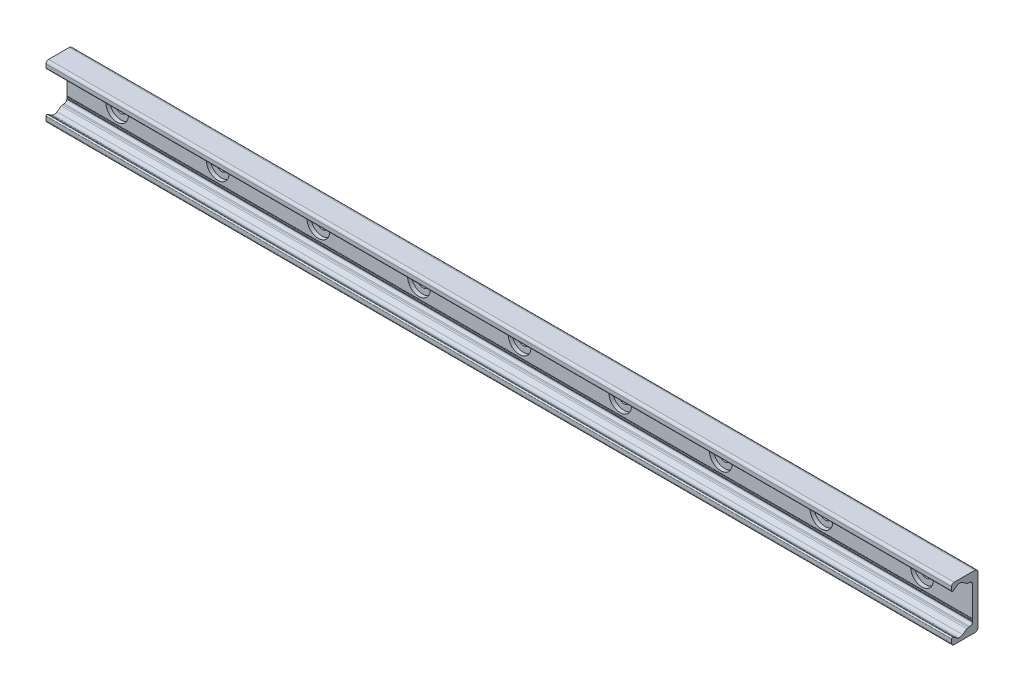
ISO-10303-21;
HEADER;
FILE_DESCRIPTION(('STEP AP214'),'2;1');
FILE_NAME('part.step','',(''),(''),'','','');
FILE_SCHEMA(('AUTOMOTIVE_DESIGN { 1 0 10303 214 1 1 1 1 }'));
ENDSEC;
DATA;
#1=APPLICATION_CONTEXT('core data for automotive mechanical design processes');
#2=APPLICATION_PROTOCOL_DEFINITION('international standard','automotive_design',2000,#1);
#3=PRODUCT_CONTEXT('',#1,'mechanical');
#4=PRODUCT('Part','Part','',(#3));
#5=PRODUCT_RELATED_PRODUCT_CATEGORY('part','',(#4));
#6=PRODUCT_DEFINITION_FORMATION('','',#4);
#7=PRODUCT_DEFINITION_CONTEXT('part definition',#1,'design');
#8=PRODUCT_DEFINITION('design','',#6,#7);
#9=PRODUCT_DEFINITION_SHAPE('','',#8);
#10=(LENGTH_UNIT() NAMED_UNIT(*) SI_UNIT(.MILLI.,.METRE.));
#11=(NAMED_UNIT(*) PLANE_ANGLE_UNIT() SI_UNIT($,.RADIAN.));
#12=(NAMED_UNIT(*) SI_UNIT($,.STERADIAN.) SOLID_ANGLE_UNIT());
#13=UNCERTAINTY_MEASURE_WITH_UNIT(LENGTH_MEASURE(1.E-05),#10,'distance_accuracy_value','');
#14=(GEOMETRIC_REPRESENTATION_CONTEXT(3) GLOBAL_UNCERTAINTY_ASSIGNED_CONTEXT((#13)) GLOBAL_UNIT_ASSIGNED_CONTEXT((#10,
#11,#12)) REPRESENTATION_CONTEXT('',''));
#15=CARTESIAN_POINT('',(0.,0.,0.));
#16=DIRECTION('',(0.,0.,1.));
#17=DIRECTION('',(1.,0.,0.));
#18=AXIS2_PLACEMENT_3D('',#15,#16,#17);
#19=CARTESIAN_POINT('',(-320.,0.,1.39999999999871));
#20=DIRECTION('',(0.,0.,1.));
#21=DIRECTION('',(1.,0.,0.));
#22=AXIS2_PLACEMENT_3D('',#19,#20,#21);
#23=PLANE('',#22);
#24=CARTESIAN_POINT('',(-320.,0.,1.39999999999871));
#25=DIRECTION('',(0.,0.,1.));
#26=DIRECTION('',(1.,0.,0.));
#27=AXIS2_PLACEMENT_3D('',#24,#25,#26);
#28=CIRCLE('',#27,4.50000000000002);
#29=CARTESIAN_POINT('',(-315.5,0.,1.39999999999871));
#30=VERTEX_POINT('',#29);
#31=EDGE_CURVE('E529',#30,#30,#28,.T.);
#32=ORIENTED_EDGE('',*,*,#31,.F.);
#33=EDGE_LOOP('',(#32));
#34=FACE_BOUND('',#33,.T.);
#35=CARTESIAN_POINT('',(-320.,0.,1.39999999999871));
#36=DIRECTION('',(0.,0.,1.));
#37=DIRECTION('',(1.,0.,0.));
#38=AXIS2_PLACEMENT_3D('',#35,#36,#37);
#39=CIRCLE('',#38,8.99999999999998);
#40=CARTESIAN_POINT('',(-311.,0.,1.39999999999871));
#41=VERTEX_POINT('',#40);
#42=EDGE_CURVE('E11',#41,#41,#39,.T.);
#43=ORIENTED_EDGE('',*,*,#42,.T.);
#44=EDGE_LOOP('',(#43));
#45=FACE_BOUND('',#44,.T.);
#46=ADVANCED_FACE('F39',(#34,#45),#23,.T.);
#47=CARTESIAN_POINT('',(-320.,0.,1.39999999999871));
#48=DIRECTION('',(0.,0.,1.));
#49=DIRECTION('',(1.,0.,0.));
#50=AXIS2_PLACEMENT_3D('',#47,#48,#49);
#51=CYLINDRICAL_SURFACE('',#50,8.99999999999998);
#52=CARTESIAN_POINT('',(-320.,0.,4.49999999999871));
#53=DIRECTION('',(0.,0.,1.));
#54=DIRECTION('',(1.,0.,0.));
#55=AXIS2_PLACEMENT_3D('',#52,#53,#54);
#56=CIRCLE('',#55,8.99999999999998);
#57=CARTESIAN_POINT('',(-311.,0.,4.49999999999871));
#58=VERTEX_POINT('',#57);
#59=EDGE_CURVE('E49',#58,#58,#56,.T.);
#60=CARTESIAN_POINT('',(-311.,0.,1.39999999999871));
#61=CARTESIAN_POINT('',(-311.,0.,1.43229166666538));
#62=CARTESIAN_POINT('',(-311.,0.,1.46458333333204));
#63=CARTESIAN_POINT('',(-311.,0.,1.52916666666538));
#64=CARTESIAN_POINT('',(-311.,0.,1.56145833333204));
#65=CARTESIAN_POINT('',(-311.,0.,1.62604166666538));
#66=CARTESIAN_POINT('',(-311.,0.,1.65833333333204));
#67=CARTESIAN_POINT('',(-311.,0.,1.72291666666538));
#68=CARTESIAN_POINT('',(-311.,0.,1.75520833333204));
#69=CARTESIAN_POINT('',(-311.,0.,1.81979166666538));
#70=CARTESIAN_POINT('',(-311.,0.,1.85208333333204));
#71=CARTESIAN_POINT('',(-311.,0.,1.91666666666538));
#72=CARTESIAN_POINT('',(-311.,0.,1.94895833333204));
#73=CARTESIAN_POINT('',(-311.,0.,2.01354166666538));
#74=CARTESIAN_POINT('',(-311.,0.,2.04583333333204));
#75=CARTESIAN_POINT('',(-311.,0.,2.11041666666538));
#76=CARTESIAN_POINT('',(-311.,0.,2.14270833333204));
#77=CARTESIAN_POINT('',(-311.,0.,2.20729166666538));
#78=CARTESIAN_POINT('',(-311.,0.,2.23958333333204));
#79=CARTESIAN_POINT('',(-311.,0.,2.30416666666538));
#80=CARTESIAN_POINT('',(-311.,0.,2.33645833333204));
#81=CARTESIAN_POINT('',(-311.,0.,2.40104166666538));
#82=CARTESIAN_POINT('',(-311.,0.,2.43333333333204));
#83=CARTESIAN_POINT('',(-311.,0.,2.49791666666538));
#84=CARTESIAN_POINT('',(-311.,0.,2.53020833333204));
#85=CARTESIAN_POINT('',(-311.,0.,2.59479166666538));
#86=CARTESIAN_POINT('',(-311.,0.,2.62708333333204));
#87=CARTESIAN_POINT('',(-311.,0.,2.69166666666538));
#88=CARTESIAN_POINT('',(-311.,0.,2.72395833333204));
#89=CARTESIAN_POINT('',(-311.,0.,2.78854166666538));
#90=CARTESIAN_POINT('',(-311.,0.,2.82083333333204));
#91=CARTESIAN_POINT('',(-311.,0.,2.88541666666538));
#92=CARTESIAN_POINT('',(-311.,0.,2.91770833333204));
#93=CARTESIAN_POINT('',(-311.,0.,2.98229166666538));
#94=CARTESIAN_POINT('',(-311.,0.,3.01458333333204));
#95=CARTESIAN_POINT('',(-311.,0.,3.07916666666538));
#96=CARTESIAN_POINT('',(-311.,0.,3.11145833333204));
#97=CARTESIAN_POINT('',(-311.,0.,3.17604166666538));
#98=CARTESIAN_POINT('',(-311.,0.,3.20833333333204));
#99=CARTESIAN_POINT('',(-311.,0.,3.27291666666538));
#100=CARTESIAN_POINT('',(-311.,0.,3.30520833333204));
#101=CARTESIAN_POINT('',(-311.,0.,3.36979166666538));
#102=CARTESIAN_POINT('',(-311.,0.,3.40208333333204));
#103=CARTESIAN_POINT('',(-311.,0.,3.46666666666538));
#104=CARTESIAN_POINT('',(-311.,0.,3.49895833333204));
#105=CARTESIAN_POINT('',(-311.,0.,3.56354166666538));
#106=CARTESIAN_POINT('',(-311.,0.,3.59583333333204));
#107=CARTESIAN_POINT('',(-311.,0.,3.66041666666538));
#108=CARTESIAN_POINT('',(-311.,0.,3.69270833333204));
#109=CARTESIAN_POINT('',(-311.,0.,3.75729166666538));
#110=CARTESIAN_POINT('',(-311.,0.,3.78958333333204));
#111=CARTESIAN_POINT('',(-311.,0.,3.85416666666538));
#112=CARTESIAN_POINT('',(-311.,0.,3.88645833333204));
#113=CARTESIAN_POINT('',(-311.,0.,3.95104166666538));
#114=CARTESIAN_POINT('',(-311.,0.,3.98333333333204));
#115=CARTESIAN_POINT('',(-311.,0.,4.04791666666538));
#116=CARTESIAN_POINT('',(-311.,0.,4.08020833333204));
#117=CARTESIAN_POINT('',(-311.,0.,4.14479166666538));
#118=CARTESIAN_POINT('',(-311.,0.,4.17708333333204));
#119=CARTESIAN_POINT('',(-311.,0.,4.24166666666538));
#120=CARTESIAN_POINT('',(-311.,0.,4.27395833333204));
#121=CARTESIAN_POINT('',(-311.,0.,4.33854166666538));
#122=CARTESIAN_POINT('',(-311.,0.,4.37083333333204));
#123=CARTESIAN_POINT('',(-311.,0.,4.43541666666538));
#124=CARTESIAN_POINT('',(-311.,0.,4.46770833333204));
#125=CARTESIAN_POINT('',(-311.,0.,4.49999999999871));
#126=B_SPLINE_CURVE_WITH_KNOTS('',3,(#60,#61,#62,#63,#64,#65,#66,#67,#68,#69,#70,#71,#72,#73,
#74,#75,#76,#77,#78,#79,#80,#81,#82,#83,#84,#85,#86,#87,#88,#89,#90,#91,#92,#93,#94,#95,#96,#97,
#98,#99,#100,#101,#102,#103,#104,#105,#106,#107,#108,#109,#110,#111,#112,#113,#114,#115,#116,
#117,#118,#119,#120,#121,#122,#123,#124,#125),.UNSPECIFIED.,.F.,.F.,(4,2,2,2,2,2,2,2,2,2,2,2,2,
2,2,2,2,2,2,2,2,2,2,2,2,2,2,2,2,2,2,2,4),(0.,0.0968750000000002,0.19375,0.290625,0.3875,
0.484375,0.58125,0.678125,0.775,0.871875,0.96875,1.065625,1.1625,1.259375,1.35625,1.453125,1.55,
1.646875,1.74375,1.840625,1.9375,2.034375,2.13125,2.228125,2.325,2.421875,2.51875,2.615625,
2.7125,2.809375,2.90625,3.003125,3.1),.UNSPECIFIED.);
#127=EDGE_CURVE('BSEAM499',#41,#58,#126,.T.);
#128=ORIENTED_EDGE('',*,*,#42,.F.);
#129=ORIENTED_EDGE('',*,*,#59,.T.);
#130=ORIENTED_EDGE('',*,*,#127,.T.);
#131=ORIENTED_EDGE('',*,*,#127,.F.);
#132=EDGE_LOOP('',(#128,#130,#129,#131));
#133=FACE_BOUND('',#132,.T.);
#134=ADVANCED_FACE('F499',(#133),#51,.F.);
#135=CARTESIAN_POINT('',(-240.,0.,1.39999999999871));
#136=DIRECTION('',(0.,0.,1.));
#137=DIRECTION('',(1.,0.,0.));
#138=AXIS2_PLACEMENT_3D('',#135,#136,#137);
#139=PLANE('',#138);
#140=CARTESIAN_POINT('',(-240.,0.,1.39999999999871));
#141=DIRECTION('',(0.,0.,1.));
#142=DIRECTION('',(1.,0.,0.));
#143=AXIS2_PLACEMENT_3D('',#140,#141,#142);
#144=CIRCLE('',#143,4.50000000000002);
#145=CARTESIAN_POINT('',(-235.5,0.,1.39999999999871));
#146=VERTEX_POINT('',#145);
#147=EDGE_CURVE('E533',#146,#146,#144,.T.);
#148=ORIENTED_EDGE('',*,*,#147,.F.);
#149=EDGE_LOOP('',(#148));
#150=FACE_BOUND('',#149,.T.);
#151=CARTESIAN_POINT('',(-240.,0.,1.39999999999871));
#152=DIRECTION('',(0.,0.,1.));
#153=DIRECTION('',(1.,0.,0.));
#154=AXIS2_PLACEMENT_3D('',#151,#152,#153);
#155=CIRCLE('',#154,8.99999999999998);
#156=CARTESIAN_POINT('',(-231.,0.,1.39999999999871));
#157=VERTEX_POINT('',#156);
#158=EDGE_CURVE('E490',#157,#157,#155,.T.);
#159=ORIENTED_EDGE('',*,*,#158,.T.);
#160=EDGE_LOOP('',(#159));
#161=FACE_BOUND('',#160,.T.);
#162=ADVANCED_FACE('F524',(#150,#161),#139,.T.);
#163=CARTESIAN_POINT('',(-240.,0.,1.39999999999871));
#164=DIRECTION('',(0.,0.,1.));
#165=DIRECTION('',(1.,0.,0.));
#166=AXIS2_PLACEMENT_3D('',#163,#164,#165);
#167=CYLINDRICAL_SURFACE('',#166,8.99999999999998);
#168=CARTESIAN_POINT('',(-240.,0.,4.49999999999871));
#169=DIRECTION('',(0.,0.,1.));
#170=DIRECTION('',(1.,0.,0.));
#171=AXIS2_PLACEMENT_3D('',#168,#169,#170);
#172=CIRCLE('',#171,8.99999999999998);
#173=CARTESIAN_POINT('',(-231.,0.,4.49999999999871));
#174=VERTEX_POINT('',#173);
#175=EDGE_CURVE('E486',#174,#174,#172,.T.);
#176=CARTESIAN_POINT('',(-231.,0.,1.39999999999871));
#177=CARTESIAN_POINT('',(-231.,0.,1.43229166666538));
#178=CARTESIAN_POINT('',(-231.,0.,1.46458333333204));
#179=CARTESIAN_POINT('',(-231.,0.,1.52916666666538));
#180=CARTESIAN_POINT('',(-231.,0.,1.56145833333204));
#181=CARTESIAN_POINT('',(-231.,0.,1.62604166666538));
#182=CARTESIAN_POINT('',(-231.,0.,1.65833333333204));
#183=CARTESIAN_POINT('',(-231.,0.,1.72291666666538));
#184=CARTESIAN_POINT('',(-231.,0.,1.75520833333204));
#185=CARTESIAN_POINT('',(-231.,0.,1.81979166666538));
#186=CARTESIAN_POINT('',(-231.,0.,1.85208333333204));
#187=CARTESIAN_POINT('',(-231.,0.,1.91666666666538));
#188=CARTESIAN_POINT('',(-231.,0.,1.94895833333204));
#189=CARTESIAN_POINT('',(-231.,0.,2.01354166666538));
#190=CARTESIAN_POINT('',(-231.,0.,2.04583333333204));
#191=CARTESIAN_POINT('',(-231.,0.,2.11041666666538));
#192=CARTESIAN_POINT('',(-231.,0.,2.14270833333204));
#193=CARTESIAN_POINT('',(-231.,0.,2.20729166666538));
#194=CARTESIAN_POINT('',(-231.,0.,2.23958333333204));
#195=CARTESIAN_POINT('',(-231.,0.,2.30416666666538));
#196=CARTESIAN_POINT('',(-231.,0.,2.33645833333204));
#197=CARTESIAN_POINT('',(-231.,0.,2.40104166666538));
#198=CARTESIAN_POINT('',(-231.,0.,2.43333333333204));
#199=CARTESIAN_POINT('',(-231.,0.,2.49791666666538));
#200=CARTESIAN_POINT('',(-231.,0.,2.53020833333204));
#201=CARTESIAN_POINT('',(-231.,0.,2.59479166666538));
#202=CARTESIAN_POINT('',(-231.,0.,2.62708333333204));
#203=CARTESIAN_POINT('',(-231.,0.,2.69166666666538));
#204=CARTESIAN_POINT('',(-231.,0.,2.72395833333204));
#205=CARTESIAN_POINT('',(-231.,0.,2.78854166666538));
#206=CARTESIAN_POINT('',(-231.,0.,2.82083333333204));
#207=CARTESIAN_POINT('',(-231.,0.,2.88541666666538));
#208=CARTESIAN_POINT('',(-231.,0.,2.91770833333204));
#209=CARTESIAN_POINT('',(-231.,0.,2.98229166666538));
#210=CARTESIAN_POINT('',(-231.,0.,3.01458333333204));
#211=CARTESIAN_POINT('',(-231.,0.,3.07916666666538));
#212=CARTESIAN_POINT('',(-231.,0.,3.11145833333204));
#213=CARTESIAN_POINT('',(-231.,0.,3.17604166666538));
#214=CARTESIAN_POINT('',(-231.,0.,3.20833333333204));
#215=CARTESIAN_POINT('',(-231.,0.,3.27291666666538));
#216=CARTESIAN_POINT('',(-231.,0.,3.30520833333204));
#217=CARTESIAN_POINT('',(-231.,0.,3.36979166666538));
#218=CARTESIAN_POINT('',(-231.,0.,3.40208333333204));
#219=CARTESIAN_POINT('',(-231.,0.,3.46666666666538));
#220=CARTESIAN_POINT('',(-231.,0.,3.49895833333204));
#221=CARTESIAN_POINT('',(-231.,0.,3.56354166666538));
#222=CARTESIAN_POINT('',(-231.,0.,3.59583333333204));
#223=CARTESIAN_POINT('',(-231.,0.,3.66041666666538));
#224=CARTESIAN_POINT('',(-231.,0.,3.69270833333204));
#225=CARTESIAN_POINT('',(-231.,0.,3.75729166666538));
#226=CARTESIAN_POINT('',(-231.,0.,3.78958333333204));
#227=CARTESIAN_POINT('',(-231.,0.,3.85416666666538));
#228=CARTESIAN_POINT('',(-231.,0.,3.88645833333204));
#229=CARTESIAN_POINT('',(-231.,0.,3.95104166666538));
#230=CARTESIAN_POINT('',(-231.,0.,3.98333333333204));
#231=CARTESIAN_POINT('',(-231.,0.,4.04791666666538));
#232=CARTESIAN_POINT('',(-231.,0.,4.08020833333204));
#233=CARTESIAN_POINT('',(-231.,0.,4.14479166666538));
#234=CARTESIAN_POINT('',(-231.,0.,4.17708333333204));
#235=CARTESIAN_POINT('',(-231.,0.,4.24166666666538));
#236=CARTESIAN_POINT('',(-231.,0.,4.27395833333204));
#237=CARTESIAN_POINT('',(-231.,0.,4.33854166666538));
#238=CARTESIAN_POINT('',(-231.,0.,4.37083333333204));
#239=CARTESIAN_POINT('',(-231.,0.,4.43541666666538));
#240=CARTESIAN_POINT('',(-231.,0.,4.46770833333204));
#241=CARTESIAN_POINT('',(-231.,0.,4.49999999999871));
#242=B_SPLINE_CURVE_WITH_KNOTS('',3,(#176,#177,#178,#179,#180,#181,#182,#183,#184,#185,#186,
#187,#188,#189,#190,#191,#192,#193,#194,#195,#196,#197,#198,#199,#200,#201,#202,#203,#204,#205,
#206,#207,#208,#209,#210,#211,#212,#213,#214,#215,#216,#217,#218,#219,#220,#221,#222,#223,#224,
#225,#226,#227,#228,#229,#230,#231,#232,#233,#234,#235,#236,#237,#238,#239,#240,#241),
.UNSPECIFIED.,.F.,.F.,(4,2,2,2,2,2,2,2,2,2,2,2,2,2,2,2,2,2,2,2,2,2,2,2,2,2,2,2,2,2,2,2,4),(0.,
0.0968750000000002,0.19375,0.290625,0.3875,0.484375,0.58125,0.678125,0.775,0.871875,0.96875,
1.065625,1.1625,1.259375,1.35625,1.453125,1.55,1.646875,1.74375,1.840625,1.9375,2.034375,
2.13125,2.228125,2.325,2.421875,2.51875,2.615625,2.7125,2.809375,2.90625,3.003125,3.1),.UNSPECIFIED.);
#243=EDGE_CURVE('BSEAM924',#157,#174,#242,.T.);
#244=ORIENTED_EDGE('',*,*,#158,.F.);
#245=ORIENTED_EDGE('',*,*,#175,.T.);
#246=ORIENTED_EDGE('',*,*,#243,.T.);
#247=ORIENTED_EDGE('',*,*,#243,.F.);
#248=EDGE_LOOP('',(#244,#246,#245,#247));
#249=FACE_BOUND('',#248,.T.);
#250=ADVANCED_FACE('F924',(#249),#167,.F.);
#251=CARTESIAN_POINT('',(-160.,0.,1.39999999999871));
#252=DIRECTION('',(0.,0.,1.));
#253=DIRECTION('',(1.,0.,0.));
#254=AXIS2_PLACEMENT_3D('',#251,#252,#253);
#255=PLANE('',#254);
#256=CARTESIAN_POINT('',(-160.,0.,1.39999999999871));
#257=DIRECTION('',(0.,0.,1.));
#258=DIRECTION('',(1.,0.,0.));
#259=AXIS2_PLACEMENT_3D('',#256,#257,#258);
#260=CIRCLE('',#259,4.50000000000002);
#261=CARTESIAN_POINT('',(-155.5,0.,1.39999999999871));
#262=VERTEX_POINT('',#261);
#263=EDGE_CURVE('E538',#262,#262,#260,.T.);
#264=ORIENTED_EDGE('',*,*,#263,.F.);
#265=EDGE_LOOP('',(#264));
#266=FACE_BOUND('',#265,.T.);
#267=CARTESIAN_POINT('',(-160.,0.,1.39999999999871));
#268=DIRECTION('',(0.,0.,1.));
#269=DIRECTION('',(1.,0.,0.));
#270=AXIS2_PLACEMENT_3D('',#267,#268,#269);
#271=CIRCLE('',#270,8.99999999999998);
#272=CARTESIAN_POINT('',(-151.,0.,1.39999999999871));
#273=VERTEX_POINT('',#272);
#274=EDGE_CURVE('E482',#273,#273,#271,.T.);
#275=ORIENTED_EDGE('',*,*,#274,.T.);
#276=EDGE_LOOP('',(#275));
#277=FACE_BOUND('',#276,.T.);
#278=ADVANCED_FACE('F920',(#266,#277),#255,.T.);
#279=CARTESIAN_POINT('',(-160.,0.,1.39999999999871));
#280=DIRECTION('',(0.,0.,1.));
#281=DIRECTION('',(1.,0.,0.));
#282=AXIS2_PLACEMENT_3D('',#279,#280,#281);
#283=CYLINDRICAL_SURFACE('',#282,8.99999999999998);
#284=CARTESIAN_POINT('',(-160.,0.,4.49999999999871));
#285=DIRECTION('',(0.,0.,1.));
#286=DIRECTION('',(1.,0.,0.));
#287=AXIS2_PLACEMENT_3D('',#284,#285,#286);
#288=CIRCLE('',#287,8.99999999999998);
#289=CARTESIAN_POINT('',(-151.,0.,4.49999999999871));
#290=VERTEX_POINT('',#289);
#291=EDGE_CURVE('E478',#290,#290,#288,.T.);
#292=CARTESIAN_POINT('',(-151.,0.,1.39999999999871));
#293=CARTESIAN_POINT('',(-151.,0.,1.43229166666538));
#294=CARTESIAN_POINT('',(-151.,0.,1.46458333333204));
#295=CARTESIAN_POINT('',(-151.,0.,1.52916666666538));
#296=CARTESIAN_POINT('',(-151.,0.,1.56145833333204));
#297=CARTESIAN_POINT('',(-151.,0.,1.62604166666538));
#298=CARTESIAN_POINT('',(-151.,0.,1.65833333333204));
#299=CARTESIAN_POINT('',(-151.,0.,1.72291666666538));
#300=CARTESIAN_POINT('',(-151.,0.,1.75520833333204));
#301=CARTESIAN_POINT('',(-151.,0.,1.81979166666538));
#302=CARTESIAN_POINT('',(-151.,0.,1.85208333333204));
#303=CARTESIAN_POINT('',(-151.,0.,1.91666666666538));
#304=CARTESIAN_POINT('',(-151.,0.,1.94895833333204));
#305=CARTESIAN_POINT('',(-151.,0.,2.01354166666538));
#306=CARTESIAN_POINT('',(-151.,0.,2.04583333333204));
#307=CARTESIAN_POINT('',(-151.,0.,2.11041666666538));
#308=CARTESIAN_POINT('',(-151.,0.,2.14270833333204));
#309=CARTESIAN_POINT('',(-151.,0.,2.20729166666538));
#310=CARTESIAN_POINT('',(-151.,0.,2.23958333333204));
#311=CARTESIAN_POINT('',(-151.,0.,2.30416666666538));
#312=CARTESIAN_POINT('',(-151.,0.,2.33645833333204));
#313=CARTESIAN_POINT('',(-151.,0.,2.40104166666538));
#314=CARTESIAN_POINT('',(-151.,0.,2.43333333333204));
#315=CARTESIAN_POINT('',(-151.,0.,2.49791666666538));
#316=CARTESIAN_POINT('',(-151.,0.,2.53020833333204));
#317=CARTESIAN_POINT('',(-151.,0.,2.59479166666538));
#318=CARTESIAN_POINT('',(-151.,0.,2.62708333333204));
#319=CARTESIAN_POINT('',(-151.,0.,2.69166666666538));
#320=CARTESIAN_POINT('',(-151.,0.,2.72395833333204));
#321=CARTESIAN_POINT('',(-151.,0.,2.78854166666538));
#322=CARTESIAN_POINT('',(-151.,0.,2.82083333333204));
#323=CARTESIAN_POINT('',(-151.,0.,2.88541666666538));
#324=CARTESIAN_POINT('',(-151.,0.,2.91770833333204));
#325=CARTESIAN_POINT('',(-151.,0.,2.98229166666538));
#326=CARTESIAN_POINT('',(-151.,0.,3.01458333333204));
#327=CARTESIAN_POINT('',(-151.,0.,3.07916666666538));
#328=CARTESIAN_POINT('',(-151.,0.,3.11145833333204));
#329=CARTESIAN_POINT('',(-151.,0.,3.17604166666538));
#330=CARTESIAN_POINT('',(-151.,0.,3.20833333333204));
#331=CARTESIAN_POINT('',(-151.,0.,3.27291666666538));
#332=CARTESIAN_POINT('',(-151.,0.,3.30520833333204));
#333=CARTESIAN_POINT('',(-151.,0.,3.36979166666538));
#334=CARTESIAN_POINT('',(-151.,0.,3.40208333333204));
#335=CARTESIAN_POINT('',(-151.,0.,3.46666666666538));
#336=CARTESIAN_POINT('',(-151.,0.,3.49895833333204));
#337=CARTESIAN_POINT('',(-151.,0.,3.56354166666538));
#338=CARTESIAN_POINT('',(-151.,0.,3.59583333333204));
#339=CARTESIAN_POINT('',(-151.,0.,3.66041666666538));
#340=CARTESIAN_POINT('',(-151.,0.,3.69270833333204));
#341=CARTESIAN_POINT('',(-151.,0.,3.75729166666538));
#342=CARTESIAN_POINT('',(-151.,0.,3.78958333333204));
#343=CARTESIAN_POINT('',(-151.,0.,3.85416666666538));
#344=CARTESIAN_POINT('',(-151.,0.,3.88645833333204));
#345=CARTESIAN_POINT('',(-151.,0.,3.95104166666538));
#346=CARTESIAN_POINT('',(-151.,0.,3.98333333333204));
#347=CARTESIAN_POINT('',(-151.,0.,4.04791666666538));
#348=CARTESIAN_POINT('',(-151.,0.,4.08020833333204));
#349=CARTESIAN_POINT('',(-151.,0.,4.14479166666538));
#350=CARTESIAN_POINT('',(-151.,0.,4.17708333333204));
#351=CARTESIAN_POINT('',(-151.,0.,4.24166666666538));
#352=CARTESIAN_POINT('',(-151.,0.,4.27395833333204));
#353=CARTESIAN_POINT('',(-151.,0.,4.33854166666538));
#354=CARTESIAN_POINT('',(-151.,0.,4.37083333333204));
#355=CARTESIAN_POINT('',(-151.,0.,4.43541666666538));
#356=CARTESIAN_POINT('',(-151.,0.,4.46770833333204));
#357=CARTESIAN_POINT('',(-151.,0.,4.49999999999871));
#358=B_SPLINE_CURVE_WITH_KNOTS('',3,(#292,#293,#294,#295,#296,#297,#298,#299,#300,#301,#302,
#303,#304,#305,#306,#307,#308,#309,#310,#311,#312,#313,#314,#315,#316,#317,#318,#319,#320,#321,
#322,#323,#324,#325,#326,#327,#328,#329,#330,#331,#332,#333,#334,#335,#336,#337,#338,#339,#340,
#341,#342,#343,#344,#345,#346,#347,#348,#349,#350,#351,#352,#353,#354,#355,#356,#357),
.UNSPECIFIED.,.F.,.F.,(4,2,2,2,2,2,2,2,2,2,2,2,2,2,2,2,2,2,2,2,2,2,2,2,2,2,2,2,2,2,2,2,4),(0.,
0.0968750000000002,0.19375,0.290625,0.3875,0.484375,0.58125,0.678125,0.775,0.871875,0.96875,
1.065625,1.1625,1.259375,1.35625,1.453125,1.55,1.646875,1.74375,1.840625,1.9375,2.034375,
2.13125,2.228125,2.325,2.421875,2.51875,2.615625,2.7125,2.809375,2.90625,3.003125,3.1),.UNSPECIFIED.);
#359=EDGE_CURVE('BSEAM916',#273,#290,#358,.T.);
#360=ORIENTED_EDGE('',*,*,#274,.F.);
#361=ORIENTED_EDGE('',*,*,#291,.T.);
#362=ORIENTED_EDGE('',*,*,#359,.T.);
#363=ORIENTED_EDGE('',*,*,#359,.F.);
#364=EDGE_LOOP('',(#360,#362,#361,#363));
#365=FACE_BOUND('',#364,.T.);
#366=ADVANCED_FACE('F916',(#365),#283,.F.);
#367=CARTESIAN_POINT('',(-80.,0.,1.39999999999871));
#368=DIRECTION('',(0.,0.,1.));
#369=DIRECTION('',(1.,0.,0.));
#370=AXIS2_PLACEMENT_3D('',#367,#368,#369);
#371=PLANE('',#370);
#372=CARTESIAN_POINT('',(-80.,0.,1.39999999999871));
#373=DIRECTION('',(0.,0.,1.));
#374=DIRECTION('',(1.,0.,0.));
#375=AXIS2_PLACEMENT_3D('',#372,#373,#374);
#376=CIRCLE('',#375,4.50000000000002);
#377=CARTESIAN_POINT('',(-75.5,0.,1.39999999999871));
#378=VERTEX_POINT('',#377);
#379=EDGE_CURVE('E549',#378,#378,#376,.T.);
#380=ORIENTED_EDGE('',*,*,#379,.F.);
#381=EDGE_LOOP('',(#380));
#382=FACE_BOUND('',#381,.T.);
#383=CARTESIAN_POINT('',(-80.,0.,1.39999999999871));
#384=DIRECTION('',(0.,0.,1.));
#385=DIRECTION('',(1.,0.,0.));
#386=AXIS2_PLACEMENT_3D('',#383,#384,#385);
#387=CIRCLE('',#386,8.99999999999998);
#388=CARTESIAN_POINT('',(-71.,0.,1.39999999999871));
#389=VERTEX_POINT('',#388);
#390=EDGE_CURVE('E474',#389,#389,#387,.T.);
#391=ORIENTED_EDGE('',*,*,#390,.T.);
#392=EDGE_LOOP('',(#391));
#393=FACE_BOUND('',#392,.T.);
#394=ADVANCED_FACE('F912',(#382,#393),#371,.T.);
#395=CARTESIAN_POINT('',(-80.,0.,1.39999999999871));
#396=DIRECTION('',(0.,0.,1.));
#397=DIRECTION('',(1.,0.,0.));
#398=AXIS2_PLACEMENT_3D('',#395,#396,#397);
#399=CYLINDRICAL_SURFACE('',#398,8.99999999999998);
#400=CARTESIAN_POINT('',(-80.,0.,4.49999999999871));
#401=DIRECTION('',(0.,0.,1.));
#402=DIRECTION('',(1.,0.,0.));
#403=AXIS2_PLACEMENT_3D('',#400,#401,#402);
#404=CIRCLE('',#403,8.99999999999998);
#405=CARTESIAN_POINT('',(-71.,0.,4.49999999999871));
#406=VERTEX_POINT('',#405);
#407=EDGE_CURVE('E470',#406,#406,#404,.T.);
#408=CARTESIAN_POINT('',(-71.,0.,1.39999999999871));
#409=CARTESIAN_POINT('',(-71.,0.,1.43229166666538));
#410=CARTESIAN_POINT('',(-71.,0.,1.46458333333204));
#411=CARTESIAN_POINT('',(-71.,0.,1.52916666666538));
#412=CARTESIAN_POINT('',(-71.,0.,1.56145833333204));
#413=CARTESIAN_POINT('',(-71.,0.,1.62604166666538));
#414=CARTESIAN_POINT('',(-71.,0.,1.65833333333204));
#415=CARTESIAN_POINT('',(-71.,0.,1.72291666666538));
#416=CARTESIAN_POINT('',(-71.,0.,1.75520833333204));
#417=CARTESIAN_POINT('',(-71.,0.,1.81979166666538));
#418=CARTESIAN_POINT('',(-71.,0.,1.85208333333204));
#419=CARTESIAN_POINT('',(-71.,0.,1.91666666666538));
#420=CARTESIAN_POINT('',(-71.,0.,1.94895833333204));
#421=CARTESIAN_POINT('',(-71.,0.,2.01354166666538));
#422=CARTESIAN_POINT('',(-71.,0.,2.04583333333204));
#423=CARTESIAN_POINT('',(-71.,0.,2.11041666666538));
#424=CARTESIAN_POINT('',(-71.,0.,2.14270833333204));
#425=CARTESIAN_POINT('',(-71.,0.,2.20729166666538));
#426=CARTESIAN_POINT('',(-71.,0.,2.23958333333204));
#427=CARTESIAN_POINT('',(-71.,0.,2.30416666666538));
#428=CARTESIAN_POINT('',(-71.,0.,2.33645833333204));
#429=CARTESIAN_POINT('',(-71.,0.,2.40104166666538));
#430=CARTESIAN_POINT('',(-71.,0.,2.43333333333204));
#431=CARTESIAN_POINT('',(-71.,0.,2.49791666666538));
#432=CARTESIAN_POINT('',(-71.,0.,2.53020833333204));
#433=CARTESIAN_POINT('',(-71.,0.,2.59479166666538));
#434=CARTESIAN_POINT('',(-71.,0.,2.62708333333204));
#435=CARTESIAN_POINT('',(-71.,0.,2.69166666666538));
#436=CARTESIAN_POINT('',(-71.,0.,2.72395833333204));
#437=CARTESIAN_POINT('',(-71.,0.,2.78854166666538));
#438=CARTESIAN_POINT('',(-71.,0.,2.82083333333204));
#439=CARTESIAN_POINT('',(-71.,0.,2.88541666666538));
#440=CARTESIAN_POINT('',(-71.,0.,2.91770833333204));
#441=CARTESIAN_POINT('',(-71.,0.,2.98229166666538));
#442=CARTESIAN_POINT('',(-71.,0.,3.01458333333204));
#443=CARTESIAN_POINT('',(-71.,0.,3.07916666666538));
#444=CARTESIAN_POINT('',(-71.,0.,3.11145833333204));
#445=CARTESIAN_POINT('',(-71.,0.,3.17604166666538));
#446=CARTESIAN_POINT('',(-71.,0.,3.20833333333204));
#447=CARTESIAN_POINT('',(-71.,0.,3.27291666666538));
#448=CARTESIAN_POINT('',(-71.,0.,3.30520833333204));
#449=CARTESIAN_POINT('',(-71.,0.,3.36979166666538));
#450=CARTESIAN_POINT('',(-71.,0.,3.40208333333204));
#451=CARTESIAN_POINT('',(-71.,0.,3.46666666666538));
#452=CARTESIAN_POINT('',(-71.,0.,3.49895833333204));
#453=CARTESIAN_POINT('',(-71.,0.,3.56354166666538));
#454=CARTESIAN_POINT('',(-71.,0.,3.59583333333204));
#455=CARTESIAN_POINT('',(-71.,0.,3.66041666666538));
#456=CARTESIAN_POINT('',(-71.,0.,3.69270833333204));
#457=CARTESIAN_POINT('',(-71.,0.,3.75729166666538));
#458=CARTESIAN_POINT('',(-71.,0.,3.78958333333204));
#459=CARTESIAN_POINT('',(-71.,0.,3.85416666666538));
#460=CARTESIAN_POINT('',(-71.,0.,3.88645833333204));
#461=CARTESIAN_POINT('',(-71.,0.,3.95104166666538));
#462=CARTESIAN_POINT('',(-71.,0.,3.98333333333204));
#463=CARTESIAN_POINT('',(-71.,0.,4.04791666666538));
#464=CARTESIAN_POINT('',(-71.,0.,4.08020833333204));
#465=CARTESIAN_POINT('',(-71.,0.,4.14479166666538));
#466=CARTESIAN_POINT('',(-71.,0.,4.17708333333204));
#467=CARTESIAN_POINT('',(-71.,0.,4.24166666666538));
#468=CARTESIAN_POINT('',(-71.,0.,4.27395833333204));
#469=CARTESIAN_POINT('',(-71.,0.,4.33854166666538));
#470=CARTESIAN_POINT('',(-71.,0.,4.37083333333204));
#471=CARTESIAN_POINT('',(-71.,0.,4.43541666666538));
#472=CARTESIAN_POINT('',(-71.,0.,4.46770833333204));
#473=CARTESIAN_POINT('',(-71.,0.,4.49999999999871));
#474=B_SPLINE_CURVE_WITH_KNOTS('',3,(#408,#409,#410,#411,#412,#413,#414,#415,#416,#417,#418,
#419,#420,#421,#422,#423,#424,#425,#426,#427,#428,#429,#430,#431,#432,#433,#434,#435,#436,#437,
#438,#439,#440,#441,#442,#443,#444,#445,#446,#447,#448,#449,#450,#451,#452,#453,#454,#455,#456,
#457,#458,#459,#460,#461,#462,#463,#464,#465,#466,#467,#468,#469,#470,#471,#472,#473),
.UNSPECIFIED.,.F.,.F.,(4,2,2,2,2,2,2,2,2,2,2,2,2,2,2,2,2,2,2,2,2,2,2,2,2,2,2,2,2,2,2,2,4),(0.,
0.0968750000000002,0.19375,0.290625,0.3875,0.484375,0.58125,0.678125,0.775,0.871875,0.96875,
1.065625,1.1625,1.259375,1.35625,1.453125,1.55,1.646875,1.74375,1.840625,1.9375,2.034375,
2.13125,2.228125,2.325,2.421875,2.51875,2.615625,2.7125,2.809375,2.90625,3.003125,3.1),.UNSPECIFIED.);
#475=EDGE_CURVE('BSEAM908',#389,#406,#474,.T.);
#476=ORIENTED_EDGE('',*,*,#390,.F.);
#477=ORIENTED_EDGE('',*,*,#407,.T.);
#478=ORIENTED_EDGE('',*,*,#475,.T.);
#479=ORIENTED_EDGE('',*,*,#475,.F.);
#480=EDGE_LOOP('',(#476,#478,#477,#479));
#481=FACE_BOUND('',#480,.T.);
#482=ADVANCED_FACE('F908',(#481),#399,.F.);
#483=CARTESIAN_POINT('',(0.,0.,1.39999999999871));
#484=DIRECTION('',(0.,0.,1.));
#485=DIRECTION('',(1.,0.,0.));
#486=AXIS2_PLACEMENT_3D('',#483,#484,#485);
#487=PLANE('',#486);
#488=CARTESIAN_POINT('',(0.,0.,1.39999999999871));
#489=DIRECTION('',(0.,0.,1.));
#490=DIRECTION('',(1.,0.,0.));
#491=AXIS2_PLACEMENT_3D('',#488,#489,#490);
#492=CIRCLE('',#491,4.50000000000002);
#493=CARTESIAN_POINT('',(4.50000000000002,0.,1.39999999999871));
#494=VERTEX_POINT('',#493);
#495=EDGE_CURVE('E553',#494,#494,#492,.T.);
#496=ORIENTED_EDGE('',*,*,#495,.F.);
#497=EDGE_LOOP('',(#496));
#498=FACE_BOUND('',#497,.T.);
#499=CARTESIAN_POINT('',(0.,0.,1.39999999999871));
#500=DIRECTION('',(0.,0.,1.));
#501=DIRECTION('',(1.,0.,0.));
#502=AXIS2_PLACEMENT_3D('',#499,#500,#501);
#503=CIRCLE('',#502,8.99999999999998);
#504=CARTESIAN_POINT('',(8.99999999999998,0.,1.39999999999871));
#505=VERTEX_POINT('',#504);
#506=EDGE_CURVE('E466',#505,#505,#503,.T.);
#507=ORIENTED_EDGE('',*,*,#506,.T.);
#508=EDGE_LOOP('',(#507));
#509=FACE_BOUND('',#508,.T.);
#510=ADVANCED_FACE('F904',(#498,#509),#487,.T.);
#511=CARTESIAN_POINT('',(0.,0.,1.39999999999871));
#512=DIRECTION('',(0.,0.,1.));
#513=DIRECTION('',(1.,0.,0.));
#514=AXIS2_PLACEMENT_3D('',#511,#512,#513);
#515=CYLINDRICAL_SURFACE('',#514,8.99999999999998);
#516=CARTESIAN_POINT('',(0.,0.,4.49999999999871));
#517=DIRECTION('',(0.,0.,1.));
#518=DIRECTION('',(1.,0.,0.));
#519=AXIS2_PLACEMENT_3D('',#516,#517,#518);
#520=CIRCLE('',#519,8.99999999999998);
#521=CARTESIAN_POINT('',(8.99999999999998,0.,4.49999999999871));
#522=VERTEX_POINT('',#521);
#523=EDGE_CURVE('E462',#522,#522,#520,.T.);
#524=CARTESIAN_POINT('',(8.99999999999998,0.,1.39999999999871));
#525=CARTESIAN_POINT('',(8.99999999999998,0.,1.43229166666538));
#526=CARTESIAN_POINT('',(8.99999999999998,0.,1.46458333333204));
#527=CARTESIAN_POINT('',(8.99999999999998,0.,1.52916666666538));
#528=CARTESIAN_POINT('',(8.99999999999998,0.,1.56145833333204));
#529=CARTESIAN_POINT('',(8.99999999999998,0.,1.62604166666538));
#530=CARTESIAN_POINT('',(8.99999999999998,0.,1.65833333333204));
#531=CARTESIAN_POINT('',(8.99999999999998,0.,1.72291666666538));
#532=CARTESIAN_POINT('',(8.99999999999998,0.,1.75520833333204));
#533=CARTESIAN_POINT('',(8.99999999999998,0.,1.81979166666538));
#534=CARTESIAN_POINT('',(8.99999999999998,0.,1.85208333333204));
#535=CARTESIAN_POINT('',(8.99999999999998,0.,1.91666666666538));
#536=CARTESIAN_POINT('',(8.99999999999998,0.,1.94895833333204));
#537=CARTESIAN_POINT('',(8.99999999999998,0.,2.01354166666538));
#538=CARTESIAN_POINT('',(8.99999999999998,0.,2.04583333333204));
#539=CARTESIAN_POINT('',(8.99999999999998,0.,2.11041666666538));
#540=CARTESIAN_POINT('',(8.99999999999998,0.,2.14270833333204));
#541=CARTESIAN_POINT('',(8.99999999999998,0.,2.20729166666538));
#542=CARTESIAN_POINT('',(8.99999999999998,0.,2.23958333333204));
#543=CARTESIAN_POINT('',(8.99999999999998,0.,2.30416666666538));
#544=CARTESIAN_POINT('',(8.99999999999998,0.,2.33645833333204));
#545=CARTESIAN_POINT('',(8.99999999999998,0.,2.40104166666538));
#546=CARTESIAN_POINT('',(8.99999999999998,0.,2.43333333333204));
#547=CARTESIAN_POINT('',(8.99999999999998,0.,2.49791666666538));
#548=CARTESIAN_POINT('',(8.99999999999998,0.,2.53020833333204));
#549=CARTESIAN_POINT('',(8.99999999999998,0.,2.59479166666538));
#550=CARTESIAN_POINT('',(8.99999999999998,0.,2.62708333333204));
#551=CARTESIAN_POINT('',(8.99999999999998,0.,2.69166666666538));
#552=CARTESIAN_POINT('',(8.99999999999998,0.,2.72395833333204));
#553=CARTESIAN_POINT('',(8.99999999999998,0.,2.78854166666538));
#554=CARTESIAN_POINT('',(8.99999999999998,0.,2.82083333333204));
#555=CARTESIAN_POINT('',(8.99999999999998,0.,2.88541666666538));
#556=CARTESIAN_POINT('',(8.99999999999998,0.,2.91770833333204));
#557=CARTESIAN_POINT('',(8.99999999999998,0.,2.98229166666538));
#558=CARTESIAN_POINT('',(8.99999999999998,0.,3.01458333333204));
#559=CARTESIAN_POINT('',(8.99999999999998,0.,3.07916666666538));
#560=CARTESIAN_POINT('',(8.99999999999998,0.,3.11145833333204));
#561=CARTESIAN_POINT('',(8.99999999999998,0.,3.17604166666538));
#562=CARTESIAN_POINT('',(8.99999999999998,0.,3.20833333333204));
#563=CARTESIAN_POINT('',(8.99999999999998,0.,3.27291666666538));
#564=CARTESIAN_POINT('',(8.99999999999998,0.,3.30520833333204));
#565=CARTESIAN_POINT('',(8.99999999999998,0.,3.36979166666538));
#566=CARTESIAN_POINT('',(8.99999999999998,0.,3.40208333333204));
#567=CARTESIAN_POINT('',(8.99999999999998,0.,3.46666666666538));
#568=CARTESIAN_POINT('',(8.99999999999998,0.,3.49895833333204));
#569=CARTESIAN_POINT('',(8.99999999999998,0.,3.56354166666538));
#570=CARTESIAN_POINT('',(8.99999999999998,0.,3.59583333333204));
#571=CARTESIAN_POINT('',(8.99999999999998,0.,3.66041666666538));
#572=CARTESIAN_POINT('',(8.99999999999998,0.,3.69270833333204));
#573=CARTESIAN_POINT('',(8.99999999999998,0.,3.75729166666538));
#574=CARTESIAN_POINT('',(8.99999999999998,0.,3.78958333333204));
#575=CARTESIAN_POINT('',(8.99999999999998,0.,3.85416666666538));
#576=CARTESIAN_POINT('',(8.99999999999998,0.,3.88645833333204));
#577=CARTESIAN_POINT('',(8.99999999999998,0.,3.95104166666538));
#578=CARTESIAN_POINT('',(8.99999999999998,0.,3.98333333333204));
#579=CARTESIAN_POINT('',(8.99999999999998,0.,4.04791666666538));
#580=CARTESIAN_POINT('',(8.99999999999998,0.,4.08020833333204));
#581=CARTESIAN_POINT('',(8.99999999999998,0.,4.14479166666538));
#582=CARTESIAN_POINT('',(8.99999999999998,0.,4.17708333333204));
#583=CARTESIAN_POINT('',(8.99999999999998,0.,4.24166666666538));
#584=CARTESIAN_POINT('',(8.99999999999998,0.,4.27395833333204));
#585=CARTESIAN_POINT('',(8.99999999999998,0.,4.33854166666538));
#586=CARTESIAN_POINT('',(8.99999999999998,0.,4.37083333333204));
#587=CARTESIAN_POINT('',(8.99999999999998,0.,4.43541666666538));
#588=CARTESIAN_POINT('',(8.99999999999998,0.,4.46770833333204));
#589=CARTESIAN_POINT('',(8.99999999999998,0.,4.49999999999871));
#590=B_SPLINE_CURVE_WITH_KNOTS('',3,(#524,#525,#526,#527,#528,#529,#530,#531,#532,#533,#534,
#535,#536,#537,#538,#539,#540,#541,#542,#543,#544,#545,#546,#547,#548,#549,#550,#551,#552,#553,
#554,#555,#556,#557,#558,#559,#560,#561,#562,#563,#564,#565,#566,#567,#568,#569,#570,#571,#572,
#573,#574,#575,#576,#577,#578,#579,#580,#581,#582,#583,#584,#585,#586,#587,#588,#589),
.UNSPECIFIED.,.F.,.F.,(4,2,2,2,2,2,2,2,2,2,2,2,2,2,2,2,2,2,2,2,2,2,2,2,2,2,2,2,2,2,2,2,4),(0.,
0.0968750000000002,0.19375,0.290625,0.3875,0.484375,0.58125,0.678125,0.775,0.871875,0.96875,
1.065625,1.1625,1.259375,1.35625,1.453125,1.55,1.646875,1.74375,1.840625,1.9375,2.034375,
2.13125,2.228125,2.325,2.421875,2.51875,2.615625,2.7125,2.809375,2.90625,3.003125,3.1),.UNSPECIFIED.);
#591=EDGE_CURVE('BSEAM900',#505,#522,#590,.T.);
#592=ORIENTED_EDGE('',*,*,#506,.F.);
#593=ORIENTED_EDGE('',*,*,#523,.T.);
#594=ORIENTED_EDGE('',*,*,#591,.T.);
#595=ORIENTED_EDGE('',*,*,#591,.F.);
#596=EDGE_LOOP('',(#592,#594,#593,#595));
#597=FACE_BOUND('',#596,.T.);
#598=ADVANCED_FACE('F900',(#597),#515,.F.);
#599=CARTESIAN_POINT('',(80.,0.,1.39999999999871));
#600=DIRECTION('',(0.,0.,1.));
#601=DIRECTION('',(1.,0.,0.));
#602=AXIS2_PLACEMENT_3D('',#599,#600,#601);
#603=PLANE('',#602);
#604=CARTESIAN_POINT('',(80.,0.,1.39999999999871));
#605=DIRECTION('',(0.,0.,1.));
#606=DIRECTION('',(1.,0.,0.));
#607=AXIS2_PLACEMENT_3D('',#604,#605,#606);
#608=CIRCLE('',#607,4.50000000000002);
#609=CARTESIAN_POINT('',(84.5,0.,1.39999999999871));
#610=VERTEX_POINT('',#609);
#611=EDGE_CURVE('E557',#610,#610,#608,.T.);
#612=ORIENTED_EDGE('',*,*,#611,.F.);
#613=EDGE_LOOP('',(#612));
#614=FACE_BOUND('',#613,.T.);
#615=CARTESIAN_POINT('',(80.,0.,1.39999999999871));
#616=DIRECTION('',(0.,0.,1.));
#617=DIRECTION('',(1.,0.,0.));
#618=AXIS2_PLACEMENT_3D('',#615,#616,#617);
#619=CIRCLE('',#618,8.99999999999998);
#620=CARTESIAN_POINT('',(89.,0.,1.39999999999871));
#621=VERTEX_POINT('',#620);
#622=EDGE_CURVE('E458',#621,#621,#619,.T.);
#623=ORIENTED_EDGE('',*,*,#622,.T.);
#624=EDGE_LOOP('',(#623));
#625=FACE_BOUND('',#624,.T.);
#626=ADVANCED_FACE('F896',(#614,#625),#603,.T.);
#627=CARTESIAN_POINT('',(80.,0.,1.39999999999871));
#628=DIRECTION('',(0.,0.,1.));
#629=DIRECTION('',(1.,0.,0.));
#630=AXIS2_PLACEMENT_3D('',#627,#628,#629);
#631=CYLINDRICAL_SURFACE('',#630,8.99999999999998);
#632=CARTESIAN_POINT('',(80.,0.,4.49999999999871));
#633=DIRECTION('',(0.,0.,1.));
#634=DIRECTION('',(1.,0.,0.));
#635=AXIS2_PLACEMENT_3D('',#632,#633,#634);
#636=CIRCLE('',#635,8.99999999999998);
#637=CARTESIAN_POINT('',(89.,0.,4.49999999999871));
#638=VERTEX_POINT('',#637);
#639=EDGE_CURVE('E454',#638,#638,#636,.T.);
#640=CARTESIAN_POINT('',(89.,0.,1.39999999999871));
#641=CARTESIAN_POINT('',(89.,0.,1.43229166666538));
#642=CARTESIAN_POINT('',(89.,0.,1.46458333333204));
#643=CARTESIAN_POINT('',(89.,0.,1.52916666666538));
#644=CARTESIAN_POINT('',(89.,0.,1.56145833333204));
#645=CARTESIAN_POINT('',(89.,0.,1.62604166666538));
#646=CARTESIAN_POINT('',(89.,0.,1.65833333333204));
#647=CARTESIAN_POINT('',(89.,0.,1.72291666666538));
#648=CARTESIAN_POINT('',(89.,0.,1.75520833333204));
#649=CARTESIAN_POINT('',(89.,0.,1.81979166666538));
#650=CARTESIAN_POINT('',(89.,0.,1.85208333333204));
#651=CARTESIAN_POINT('',(89.,0.,1.91666666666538));
#652=CARTESIAN_POINT('',(89.,0.,1.94895833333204));
#653=CARTESIAN_POINT('',(89.,0.,2.01354166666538));
#654=CARTESIAN_POINT('',(89.,0.,2.04583333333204));
#655=CARTESIAN_POINT('',(89.,0.,2.11041666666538));
#656=CARTESIAN_POINT('',(89.,0.,2.14270833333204));
#657=CARTESIAN_POINT('',(89.,0.,2.20729166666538));
#658=CARTESIAN_POINT('',(89.,0.,2.23958333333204));
#659=CARTESIAN_POINT('',(89.,0.,2.30416666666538));
#660=CARTESIAN_POINT('',(89.,0.,2.33645833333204));
#661=CARTESIAN_POINT('',(89.,0.,2.40104166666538));
#662=CARTESIAN_POINT('',(89.,0.,2.43333333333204));
#663=CARTESIAN_POINT('',(89.,0.,2.49791666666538));
#664=CARTESIAN_POINT('',(89.,0.,2.53020833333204));
#665=CARTESIAN_POINT('',(89.,0.,2.59479166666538));
#666=CARTESIAN_POINT('',(89.,0.,2.62708333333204));
#667=CARTESIAN_POINT('',(89.,0.,2.69166666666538));
#668=CARTESIAN_POINT('',(89.,0.,2.72395833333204));
#669=CARTESIAN_POINT('',(89.,0.,2.78854166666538));
#670=CARTESIAN_POINT('',(89.,0.,2.82083333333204));
#671=CARTESIAN_POINT('',(89.,0.,2.88541666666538));
#672=CARTESIAN_POINT('',(89.,0.,2.91770833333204));
#673=CARTESIAN_POINT('',(89.,0.,2.98229166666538));
#674=CARTESIAN_POINT('',(89.,0.,3.01458333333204));
#675=CARTESIAN_POINT('',(89.,0.,3.07916666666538));
#676=CARTESIAN_POINT('',(89.,0.,3.11145833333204));
#677=CARTESIAN_POINT('',(89.,0.,3.17604166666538));
#678=CARTESIAN_POINT('',(89.,0.,3.20833333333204));
#679=CARTESIAN_POINT('',(89.,0.,3.27291666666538));
#680=CARTESIAN_POINT('',(89.,0.,3.30520833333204));
#681=CARTESIAN_POINT('',(89.,0.,3.36979166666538));
#682=CARTESIAN_POINT('',(89.,0.,3.40208333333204));
#683=CARTESIAN_POINT('',(89.,0.,3.46666666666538));
#684=CARTESIAN_POINT('',(89.,0.,3.49895833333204));
#685=CARTESIAN_POINT('',(89.,0.,3.56354166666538));
#686=CARTESIAN_POINT('',(89.,0.,3.59583333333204));
#687=CARTESIAN_POINT('',(89.,0.,3.66041666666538));
#688=CARTESIAN_POINT('',(89.,0.,3.69270833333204));
#689=CARTESIAN_POINT('',(89.,0.,3.75729166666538));
#690=CARTESIAN_POINT('',(89.,0.,3.78958333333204));
#691=CARTESIAN_POINT('',(89.,0.,3.85416666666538));
#692=CARTESIAN_POINT('',(89.,0.,3.88645833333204));
#693=CARTESIAN_POINT('',(89.,0.,3.95104166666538));
#694=CARTESIAN_POINT('',(89.,0.,3.98333333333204));
#695=CARTESIAN_POINT('',(89.,0.,4.04791666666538));
#696=CARTESIAN_POINT('',(89.,0.,4.08020833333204));
#697=CARTESIAN_POINT('',(89.,0.,4.14479166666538));
#698=CARTESIAN_POINT('',(89.,0.,4.17708333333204));
#699=CARTESIAN_POINT('',(89.,0.,4.24166666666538));
#700=CARTESIAN_POINT('',(89.,0.,4.27395833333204));
#701=CARTESIAN_POINT('',(89.,0.,4.33854166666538));
#702=CARTESIAN_POINT('',(89.,0.,4.37083333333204));
#703=CARTESIAN_POINT('',(89.,0.,4.43541666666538));
#704=CARTESIAN_POINT('',(89.,0.,4.46770833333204));
#705=CARTESIAN_POINT('',(89.,0.,4.49999999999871));
#706=B_SPLINE_CURVE_WITH_KNOTS('',3,(#640,#641,#642,#643,#644,#645,#646,#647,#648,#649,#650,
#651,#652,#653,#654,#655,#656,#657,#658,#659,#660,#661,#662,#663,#664,#665,#666,#667,#668,#669,
#670,#671,#672,#673,#674,#675,#676,#677,#678,#679,#680,#681,#682,#683,#684,#685,#686,#687,#688,
#689,#690,#691,#692,#693,#694,#695,#696,#697,#698,#699,#700,#701,#702,#703,#704,#705),
.UNSPECIFIED.,.F.,.F.,(4,2,2,2,2,2,2,2,2,2,2,2,2,2,2,2,2,2,2,2,2,2,2,2,2,2,2,2,2,2,2,2,4),(0.,
0.0968750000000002,0.19375,0.290625,0.3875,0.484375,0.58125,0.678125,0.775,0.871875,0.96875,
1.065625,1.1625,1.259375,1.35625,1.453125,1.55,1.646875,1.74375,1.840625,1.9375,2.034375,
2.13125,2.228125,2.325,2.421875,2.51875,2.615625,2.7125,2.809375,2.90625,3.003125,3.1),.UNSPECIFIED.);
#707=EDGE_CURVE('BSEAM892',#621,#638,#706,.T.);
#708=ORIENTED_EDGE('',*,*,#622,.F.);
#709=ORIENTED_EDGE('',*,*,#639,.T.);
#710=ORIENTED_EDGE('',*,*,#707,.T.);
#711=ORIENTED_EDGE('',*,*,#707,.F.);
#712=EDGE_LOOP('',(#708,#710,#709,#711));
#713=FACE_BOUND('',#712,.T.);
#714=ADVANCED_FACE('F892',(#713),#631,.F.);
#715=CARTESIAN_POINT('',(160.,0.,1.39999999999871));
#716=DIRECTION('',(0.,0.,1.));
#717=DIRECTION('',(1.,0.,0.));
#718=AXIS2_PLACEMENT_3D('',#715,#716,#717);
#719=PLANE('',#718);
#720=CARTESIAN_POINT('',(160.,0.,1.39999999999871));
#721=DIRECTION('',(0.,0.,1.));
#722=DIRECTION('',(1.,0.,0.));
#723=AXIS2_PLACEMENT_3D('',#720,#721,#722);
#724=CIRCLE('',#723,4.50000000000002);
#725=CARTESIAN_POINT('',(164.5,0.,1.39999999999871));
#726=VERTEX_POINT('',#725);
#727=EDGE_CURVE('E560',#726,#726,#724,.T.);
#728=ORIENTED_EDGE('',*,*,#727,.F.);
#729=EDGE_LOOP('',(#728));
#730=FACE_BOUND('',#729,.T.);
#731=CARTESIAN_POINT('',(160.,0.,1.39999999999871));
#732=DIRECTION('',(0.,0.,1.));
#733=DIRECTION('',(1.,0.,0.));
#734=AXIS2_PLACEMENT_3D('',#731,#732,#733);
#735=CIRCLE('',#734,8.99999999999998);
#736=CARTESIAN_POINT('',(169.,0.,1.39999999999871));
#737=VERTEX_POINT('',#736);
#738=EDGE_CURVE('E450',#737,#737,#735,.T.);
#739=ORIENTED_EDGE('',*,*,#738,.T.);
#740=EDGE_LOOP('',(#739));
#741=FACE_BOUND('',#740,.T.);
#742=ADVANCED_FACE('F883',(#730,#741),#719,.T.);
#743=CARTESIAN_POINT('',(160.,0.,1.39999999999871));
#744=DIRECTION('',(0.,0.,1.));
#745=DIRECTION('',(1.,0.,0.));
#746=AXIS2_PLACEMENT_3D('',#743,#744,#745);
#747=CYLINDRICAL_SURFACE('',#746,8.99999999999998);
#748=CARTESIAN_POINT('',(160.,0.,4.49999999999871));
#749=DIRECTION('',(0.,0.,1.));
#750=DIRECTION('',(1.,0.,0.));
#751=AXIS2_PLACEMENT_3D('',#748,#749,#750);
#752=CIRCLE('',#751,8.99999999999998);
#753=CARTESIAN_POINT('',(169.,0.,4.49999999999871));
#754=VERTEX_POINT('',#753);
#755=EDGE_CURVE('E447',#754,#754,#752,.T.);
#756=CARTESIAN_POINT('',(169.,0.,1.39999999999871));
#757=CARTESIAN_POINT('',(169.,0.,1.43229166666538));
#758=CARTESIAN_POINT('',(169.,0.,1.46458333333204));
#759=CARTESIAN_POINT('',(169.,0.,1.52916666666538));
#760=CARTESIAN_POINT('',(169.,0.,1.56145833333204));
#761=CARTESIAN_POINT('',(169.,0.,1.62604166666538));
#762=CARTESIAN_POINT('',(169.,0.,1.65833333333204));
#763=CARTESIAN_POINT('',(169.,0.,1.72291666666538));
#764=CARTESIAN_POINT('',(169.,0.,1.75520833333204));
#765=CARTESIAN_POINT('',(169.,0.,1.81979166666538));
#766=CARTESIAN_POINT('',(169.,0.,1.85208333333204));
#767=CARTESIAN_POINT('',(169.,0.,1.91666666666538));
#768=CARTESIAN_POINT('',(169.,0.,1.94895833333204));
#769=CARTESIAN_POINT('',(169.,0.,2.01354166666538));
#770=CARTESIAN_POINT('',(169.,0.,2.04583333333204));
#771=CARTESIAN_POINT('',(169.,0.,2.11041666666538));
#772=CARTESIAN_POINT('',(169.,0.,2.14270833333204));
#773=CARTESIAN_POINT('',(169.,0.,2.20729166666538));
#774=CARTESIAN_POINT('',(169.,0.,2.23958333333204));
#775=CARTESIAN_POINT('',(169.,0.,2.30416666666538));
#776=CARTESIAN_POINT('',(169.,0.,2.33645833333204));
#777=CARTESIAN_POINT('',(169.,0.,2.40104166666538));
#778=CARTESIAN_POINT('',(169.,0.,2.43333333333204));
#779=CARTESIAN_POINT('',(169.,0.,2.49791666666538));
#780=CARTESIAN_POINT('',(169.,0.,2.53020833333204));
#781=CARTESIAN_POINT('',(169.,0.,2.59479166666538));
#782=CARTESIAN_POINT('',(169.,0.,2.62708333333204));
#783=CARTESIAN_POINT('',(169.,0.,2.69166666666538));
#784=CARTESIAN_POINT('',(169.,0.,2.72395833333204));
#785=CARTESIAN_POINT('',(169.,0.,2.78854166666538));
#786=CARTESIAN_POINT('',(169.,0.,2.82083333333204));
#787=CARTESIAN_POINT('',(169.,0.,2.88541666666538));
#788=CARTESIAN_POINT('',(169.,0.,2.91770833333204));
#789=CARTESIAN_POINT('',(169.,0.,2.98229166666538));
#790=CARTESIAN_POINT('',(169.,0.,3.01458333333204));
#791=CARTESIAN_POINT('',(169.,0.,3.07916666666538));
#792=CARTESIAN_POINT('',(169.,0.,3.11145833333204));
#793=CARTESIAN_POINT('',(169.,0.,3.17604166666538));
#794=CARTESIAN_POINT('',(169.,0.,3.20833333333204));
#795=CARTESIAN_POINT('',(169.,0.,3.27291666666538));
#796=CARTESIAN_POINT('',(169.,0.,3.30520833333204));
#797=CARTESIAN_POINT('',(169.,0.,3.36979166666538));
#798=CARTESIAN_POINT('',(169.,0.,3.40208333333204));
#799=CARTESIAN_POINT('',(169.,0.,3.46666666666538));
#800=CARTESIAN_POINT('',(169.,0.,3.49895833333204));
#801=CARTESIAN_POINT('',(169.,0.,3.56354166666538));
#802=CARTESIAN_POINT('',(169.,0.,3.59583333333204));
#803=CARTESIAN_POINT('',(169.,0.,3.66041666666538));
#804=CARTESIAN_POINT('',(169.,0.,3.69270833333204));
#805=CARTESIAN_POINT('',(169.,0.,3.75729166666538));
#806=CARTESIAN_POINT('',(169.,0.,3.78958333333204));
#807=CARTESIAN_POINT('',(169.,0.,3.85416666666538));
#808=CARTESIAN_POINT('',(169.,0.,3.88645833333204));
#809=CARTESIAN_POINT('',(169.,0.,3.95104166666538));
#810=CARTESIAN_POINT('',(169.,0.,3.98333333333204));
#811=CARTESIAN_POINT('',(169.,0.,4.04791666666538));
#812=CARTESIAN_POINT('',(169.,0.,4.08020833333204));
#813=CARTESIAN_POINT('',(169.,0.,4.14479166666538));
#814=CARTESIAN_POINT('',(169.,0.,4.17708333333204));
#815=CARTESIAN_POINT('',(169.,0.,4.24166666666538));
#816=CARTESIAN_POINT('',(169.,0.,4.27395833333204));
#817=CARTESIAN_POINT('',(169.,0.,4.33854166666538));
#818=CARTESIAN_POINT('',(169.,0.,4.37083333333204));
#819=CARTESIAN_POINT('',(169.,0.,4.43541666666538));
#820=CARTESIAN_POINT('',(169.,0.,4.46770833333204));
#821=CARTESIAN_POINT('',(169.,0.,4.49999999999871));
#822=B_SPLINE_CURVE_WITH_KNOTS('',3,(#756,#757,#758,#759,#760,#761,#762,#763,#764,#765,#766,
#767,#768,#769,#770,#771,#772,#773,#774,#775,#776,#777,#778,#779,#780,#781,#782,#783,#784,#785,
#786,#787,#788,#789,#790,#791,#792,#793,#794,#795,#796,#797,#798,#799,#800,#801,#802,#803,#804,
#805,#806,#807,#808,#809,#810,#811,#812,#813,#814,#815,#816,#817,#818,#819,#820,#821),
.UNSPECIFIED.,.F.,.F.,(4,2,2,2,2,2,2,2,2,2,2,2,2,2,2,2,2,2,2,2,2,2,2,2,2,2,2,2,2,2,2,2,4),(0.,
0.0968750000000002,0.19375,0.290625,0.3875,0.484375,0.58125,0.678125,0.775,0.871875,0.96875,
1.065625,1.1625,1.259375,1.35625,1.453125,1.55,1.646875,1.74375,1.840625,1.9375,2.034375,
2.13125,2.228125,2.325,2.421875,2.51875,2.615625,2.7125,2.809375,2.90625,3.003125,3.1),.UNSPECIFIED.);
#823=EDGE_CURVE('BSEAM875',#737,#754,#822,.T.);
#824=ORIENTED_EDGE('',*,*,#738,.F.);
#825=ORIENTED_EDGE('',*,*,#755,.T.);
#826=ORIENTED_EDGE('',*,*,#823,.T.);
#827=ORIENTED_EDGE('',*,*,#823,.F.);
#828=EDGE_LOOP('',(#824,#826,#825,#827));
#829=FACE_BOUND('',#828,.T.);
#830=ADVANCED_FACE('F875',(#829),#747,.F.);
#831=CARTESIAN_POINT('',(360.,0.,0.));
#832=DIRECTION('',(0.,0.,1.));
#833=DIRECTION('',(1.,0.,0.));
#834=AXIS2_PLACEMENT_3D('',#831,#832,#833);
#835=PLANE('',#834);
#836=CARTESIAN_POINT('',(240.,0.,0.));
#837=DIRECTION('',(0.,0.,1.));
#838=DIRECTION('',(1.,0.,0.));
#839=AXIS2_PLACEMENT_3D('',#836,#837,#838);
#840=CIRCLE('',#839,4.50000000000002);
#841=CARTESIAN_POINT('',(244.5,0.,0.));
#842=VERTEX_POINT('',#841);
#843=EDGE_CURVE('E542',#842,#842,#840,.T.);
#844=ORIENTED_EDGE('',*,*,#843,.T.);
#845=EDGE_LOOP('',(#844));
#846=FACE_BOUND('',#845,.T.);
#847=CARTESIAN_POINT('',(160.,0.,0.));
#848=DIRECTION('',(0.,0.,1.));
#849=DIRECTION('',(1.,0.,0.));
#850=AXIS2_PLACEMENT_3D('',#847,#848,#849);
#851=CIRCLE('',#850,4.50000000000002);
#852=CARTESIAN_POINT('',(164.5,0.,0.));
#853=VERTEX_POINT('',#852);
#854=EDGE_CURVE('E670',#853,#853,#851,.T.);
#855=ORIENTED_EDGE('',*,*,#854,.T.);
#856=EDGE_LOOP('',(#855));
#857=FACE_BOUND('',#856,.T.);
#858=CARTESIAN_POINT('',(80.,0.,0.));
#859=DIRECTION('',(0.,0.,1.));
#860=DIRECTION('',(1.,0.,0.));
#861=AXIS2_PLACEMENT_3D('',#858,#859,#860);
#862=CIRCLE('',#861,4.50000000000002);
#863=CARTESIAN_POINT('',(84.5,0.,0.));
#864=VERTEX_POINT('',#863);
#865=EDGE_CURVE('E663',#864,#864,#862,.T.);
#866=ORIENTED_EDGE('',*,*,#865,.T.);
#867=EDGE_LOOP('',(#866));
#868=FACE_BOUND('',#867,.T.);
#869=CARTESIAN_POINT('',(0.,0.,0.));
#870=DIRECTION('',(0.,0.,1.));
#871=DIRECTION('',(1.,0.,0.));
#872=AXIS2_PLACEMENT_3D('',#869,#870,#871);
#873=CIRCLE('',#872,4.50000000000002);
#874=CARTESIAN_POINT('',(4.50000000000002,0.,0.));
#875=VERTEX_POINT('',#874);
#876=EDGE_CURVE('E661',#875,#875,#873,.T.);
#877=ORIENTED_EDGE('',*,*,#876,.T.);
#878=EDGE_LOOP('',(#877));
#879=FACE_BOUND('',#878,.T.);
#880=CARTESIAN_POINT('',(-80.,0.,0.));
#881=DIRECTION('',(0.,0.,1.));
#882=DIRECTION('',(1.,0.,0.));
#883=AXIS2_PLACEMENT_3D('',#880,#881,#882);
#884=CIRCLE('',#883,4.50000000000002);
#885=CARTESIAN_POINT('',(-75.5,0.,0.));
#886=VERTEX_POINT('',#885);
#887=EDGE_CURVE('E664',#886,#886,#884,.T.);
#888=ORIENTED_EDGE('',*,*,#887,.T.);
#889=EDGE_LOOP('',(#888));
#890=FACE_BOUND('',#889,.T.);
#891=CARTESIAN_POINT('',(-160.,0.,0.));
#892=DIRECTION('',(0.,0.,1.));
#893=DIRECTION('',(1.,0.,0.));
#894=AXIS2_PLACEMENT_3D('',#891,#892,#893);
#895=CIRCLE('',#894,4.50000000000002);
#896=CARTESIAN_POINT('',(-155.5,0.,0.));
#897=VERTEX_POINT('',#896);
#898=EDGE_CURVE('E674',#897,#897,#895,.T.);
#899=ORIENTED_EDGE('',*,*,#898,.T.);
#900=EDGE_LOOP('',(#899));
#901=FACE_BOUND('',#900,.T.);
#902=CARTESIAN_POINT('',(-240.,0.,0.));
#903=DIRECTION('',(0.,0.,1.));
#904=DIRECTION('',(1.,0.,0.));
#905=AXIS2_PLACEMENT_3D('',#902,#903,#904);
#906=CIRCLE('',#905,4.50000000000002);
#907=CARTESIAN_POINT('',(-235.5,0.,0.));
#908=VERTEX_POINT('',#907);
#909=EDGE_CURVE('E659',#908,#908,#906,.T.);
#910=ORIENTED_EDGE('',*,*,#909,.T.);
#911=EDGE_LOOP('',(#910));
#912=FACE_BOUND('',#911,.T.);
#913=CARTESIAN_POINT('',(-320.,0.,0.));
#914=DIRECTION('',(0.,0.,1.));
#915=DIRECTION('',(1.,0.,0.));
#916=AXIS2_PLACEMENT_3D('',#913,#914,#915);
#917=CIRCLE('',#916,4.50000000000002);
#918=CARTESIAN_POINT('',(-315.5,0.,0.));
#919=VERTEX_POINT('',#918);
#920=EDGE_CURVE('E544',#919,#919,#917,.T.);
#921=ORIENTED_EDGE('',*,*,#920,.T.);
#922=EDGE_LOOP('',(#921));
#923=FACE_BOUND('',#922,.T.);
#924=CARTESIAN_POINT('',(320.,0.,0.));
#925=DIRECTION('',(0.,0.,1.));
#926=DIRECTION('',(1.,0.,0.));
#927=AXIS2_PLACEMENT_3D('',#924,#925,#926);
#928=CIRCLE('',#927,4.50000000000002);
#929=CARTESIAN_POINT('',(324.5,0.,0.));
#930=VERTEX_POINT('',#929);
#931=EDGE_CURVE('E572',#930,#930,#928,.T.);
#932=ORIENTED_EDGE('',*,*,#931,.T.);
#933=EDGE_LOOP('',(#932));
#934=FACE_BOUND('',#933,.T.);
#935=DIRECTION('',(0.,1.,0.));
#936=VECTOR('',#935,1.);
#937=CARTESIAN_POINT('',(-360.,0.,0.));
#938=LINE('',#937,#936);
#939=CARTESIAN_POINT('',(-360.,-19.,0.));
#940=VERTEX_POINT('',#939);
#941=CARTESIAN_POINT('',(-360.,19.,0.));
#942=VERTEX_POINT('',#941);
#943=EDGE_CURVE('E153',#940,#942,#938,.T.);
#944=ORIENTED_EDGE('',*,*,#943,.T.);
#945=DIRECTION('',(-1.,0.,0.));
#946=VECTOR('',#945,1.);
#947=CARTESIAN_POINT('',(360.,19.,0.));
#948=LINE('',#947,#946);
#949=CARTESIAN_POINT('',(360.,19.,0.));
#950=VERTEX_POINT('',#949);
#951=EDGE_CURVE('E443',#950,#942,#948,.T.);
#952=ORIENTED_EDGE('',*,*,#951,.F.);
#953=DIRECTION('',(0.,1.,0.));
#954=VECTOR('',#953,1.);
#955=CARTESIAN_POINT('',(360.,0.,0.));
#956=LINE('',#955,#954);
#957=CARTESIAN_POINT('',(360.,-19.,0.));
#958=VERTEX_POINT('',#957);
#959=EDGE_CURVE('E159',#958,#950,#956,.T.);
#960=ORIENTED_EDGE('',*,*,#959,.F.);
#961=DIRECTION('',(-1.,0.,0.));
#962=VECTOR('',#961,1.);
#963=CARTESIAN_POINT('',(360.,-19.,0.));
#964=LINE('',#963,#962);
#965=EDGE_CURVE('E259',#958,#940,#964,.T.);
#966=ORIENTED_EDGE('',*,*,#965,.T.);
#967=EDGE_LOOP('',(#944,#952,#960,#966));
#968=FACE_BOUND('',#967,.T.);
#969=ADVANCED_FACE('F687',(#846,#857,#868,#879,#890,#901,#912,#923,#934,#968),#835,.F.);
#970=CARTESIAN_POINT('',(360.,19.,2.5));
#971=DIRECTION('',(-1.,0.,0.));
#972=DIRECTION('',(0.,0.,1.));
#973=AXIS2_PLACEMENT_3D('',#970,#971,#972);
#974=CYLINDRICAL_SURFACE('',#973,2.5);
#975=CARTESIAN_POINT('',(-360.,19.,2.5));
#976=DIRECTION('',(1.,0.,0.));
#977=DIRECTION('',(0.,0.,-1.));
#978=AXIS2_PLACEMENT_3D('',#975,#976,#977);
#979=CIRCLE('',#978,2.5);
#980=CARTESIAN_POINT('',(-360.,21.5,2.5));
#981=VERTEX_POINT('',#980);
#982=EDGE_CURVE('E265',#942,#981,#979,.T.);
#983=ORIENTED_EDGE('',*,*,#982,.T.);
#984=DIRECTION('',(-1.,0.,0.));
#985=VECTOR('',#984,1.);
#986=CARTESIAN_POINT('',(360.,21.5,2.5));
#987=LINE('',#986,#985);
#988=CARTESIAN_POINT('',(360.,21.5,2.5));
#989=VERTEX_POINT('',#988);
#990=EDGE_CURVE('E439',#989,#981,#987,.T.);
#991=ORIENTED_EDGE('',*,*,#990,.F.);
#992=CARTESIAN_POINT('',(360.,19.,2.5));
#993=DIRECTION('',(1.,0.,0.));
#994=DIRECTION('',(0.,0.,-1.));
#995=AXIS2_PLACEMENT_3D('',#992,#993,#994);
#996=CIRCLE('',#995,2.5);
#997=EDGE_CURVE('E589',#950,#989,#996,.T.);
#998=ORIENTED_EDGE('',*,*,#997,.F.);
#999=ORIENTED_EDGE('',*,*,#951,.T.);
#1000=EDGE_LOOP('',(#983,#991,#998,#999));
#1001=FACE_BOUND('',#1000,.T.);
#1002=ADVANCED_FACE('F856',(#1001),#974,.T.);
#1003=CARTESIAN_POINT('',(360.,21.5,2.5));
#1004=DIRECTION('',(0.,-1.,0.));
#1005=DIRECTION('',(0.,0.,-1.));
#1006=AXIS2_PLACEMENT_3D('',#1003,#1004,#1005);
#1007=PLANE('',#1006);
#1008=DIRECTION('',(0.,0.,1.));
#1009=VECTOR('',#1008,1.);
#1010=CARTESIAN_POINT('',(-360.,21.5,2.5));
#1011=LINE('',#1010,#1009);
#1012=CARTESIAN_POINT('',(-360.,21.5,19.000000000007));
#1013=VERTEX_POINT('',#1012);
#1014=EDGE_CURVE('E269',#981,#1013,#1011,.T.);
#1015=ORIENTED_EDGE('',*,*,#1014,.T.);
#1016=DIRECTION('',(-1.,0.,0.));
#1017=VECTOR('',#1016,1.);
#1018=CARTESIAN_POINT('',(360.,21.5,19.000000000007));
#1019=LINE('',#1018,#1017);
#1020=CARTESIAN_POINT('',(360.,21.5,19.000000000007));
#1021=VERTEX_POINT('',#1020);
#1022=EDGE_CURVE('E435',#1021,#1013,#1019,.T.);
#1023=ORIENTED_EDGE('',*,*,#1022,.F.);
#1024=DIRECTION('',(0.,0.,1.));
#1025=VECTOR('',#1024,1.);
#1026=CARTESIAN_POINT('',(360.,21.5,2.5));
#1027=LINE('',#1026,#1025);
#1028=EDGE_CURVE('E592',#989,#1021,#1027,.T.);
#1029=ORIENTED_EDGE('',*,*,#1028,.F.);
#1030=ORIENTED_EDGE('',*,*,#990,.T.);
#1031=EDGE_LOOP('',(#1015,#1023,#1029,#1030));
#1032=FACE_BOUND('',#1031,.T.);
#1033=ADVANCED_FACE('F852',(#1032),#1007,.F.);
#1034=CARTESIAN_POINT('',(360.,19.4999999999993,19.000000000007));
#1035=DIRECTION('',(-1.,0.,0.));
#1036=DIRECTION('',(0.,0.,1.));
#1037=AXIS2_PLACEMENT_3D('',#1034,#1035,#1036);
#1038=CYLINDRICAL_SURFACE('',#1037,2.00000000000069);
#1039=CARTESIAN_POINT('',(-360.,19.4999999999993,19.000000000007));
#1040=DIRECTION('',(1.,0.,0.));
#1041=DIRECTION('',(0.,0.,-1.));
#1042=AXIS2_PLACEMENT_3D('',#1039,#1040,#1041);
#1043=CIRCLE('',#1042,2.00000000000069);
#1044=CARTESIAN_POINT('',(-360.,19.4999999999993,21.0000000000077));
#1045=VERTEX_POINT('',#1044);
#1046=EDGE_CURVE('E272',#1013,#1045,#1043,.T.);
#1047=ORIENTED_EDGE('',*,*,#1046,.T.);
#1048=DIRECTION('',(-1.,0.,0.));
#1049=VECTOR('',#1048,1.);
#1050=CARTESIAN_POINT('',(360.,19.4999999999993,21.0000000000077));
#1051=LINE('',#1050,#1049);
#1052=CARTESIAN_POINT('',(360.,19.4999999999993,21.0000000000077));
#1053=VERTEX_POINT('',#1052);
#1054=EDGE_CURVE('E431',#1053,#1045,#1051,.T.);
#1055=ORIENTED_EDGE('',*,*,#1054,.F.);
#1056=CARTESIAN_POINT('',(360.,19.4999999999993,19.000000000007));
#1057=DIRECTION('',(1.,0.,0.));
#1058=DIRECTION('',(0.,0.,-1.));
#1059=AXIS2_PLACEMENT_3D('',#1056,#1057,#1058);
#1060=CIRCLE('',#1059,2.00000000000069);
#1061=EDGE_CURVE('E595',#1021,#1053,#1060,.T.);
#1062=ORIENTED_EDGE('',*,*,#1061,.F.);
#1063=ORIENTED_EDGE('',*,*,#1022,.T.);
#1064=EDGE_LOOP('',(#1047,#1055,#1062,#1063));
#1065=FACE_BOUND('',#1064,.T.);
#1066=ADVANCED_FACE('F847',(#1065),#1038,.T.);
#1067=CARTESIAN_POINT('',(360.,19.4999999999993,21.0000000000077));
#1068=DIRECTION('',(0.,0.,-1.));
#1069=DIRECTION('',(-1.,0.,0.));
#1070=AXIS2_PLACEMENT_3D('',#1067,#1068,#1069);
#1071=PLANE('',#1070);
#1072=DIRECTION('',(0.,-1.,0.));
#1073=VECTOR('',#1072,1.);
#1074=CARTESIAN_POINT('',(-360.,19.4999999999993,21.0000000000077));
#1075=LINE('',#1074,#1073);
#1076=CARTESIAN_POINT('',(-360.,16.6250570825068,21.0000000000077));
#1077=VERTEX_POINT('',#1076);
#1078=EDGE_CURVE('E275',#1045,#1077,#1075,.T.);
#1079=ORIENTED_EDGE('',*,*,#1078,.T.);
#1080=DIRECTION('',(-1.,0.,0.));
#1081=VECTOR('',#1080,1.);
#1082=CARTESIAN_POINT('',(360.,16.6250570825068,21.0000000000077));
#1083=LINE('',#1082,#1081);
#1084=CARTESIAN_POINT('',(360.,16.6250570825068,21.0000000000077));
#1085=VERTEX_POINT('',#1084);
#1086=EDGE_CURVE('E427',#1085,#1077,#1083,.T.);
#1087=ORIENTED_EDGE('',*,*,#1086,.F.);
#1088=DIRECTION('',(0.,-1.,0.));
#1089=VECTOR('',#1088,1.);
#1090=CARTESIAN_POINT('',(360.,19.4999999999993,21.0000000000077));
#1091=LINE('',#1090,#1089);
#1092=EDGE_CURVE('E598',#1053,#1085,#1091,.T.);
#1093=ORIENTED_EDGE('',*,*,#1092,.F.);
#1094=ORIENTED_EDGE('',*,*,#1054,.T.);
#1095=EDGE_LOOP('',(#1079,#1087,#1093,#1094));
#1096=FACE_BOUND('',#1095,.T.);
#1097=ADVANCED_FACE('F842',(#1096),#1071,.F.);
#1098=CARTESIAN_POINT('',(360.,16.6250570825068,20.1700000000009));
#1099=DIRECTION('',(-1.,0.,0.));
#1100=DIRECTION('',(0.,0.,1.));
#1101=AXIS2_PLACEMENT_3D('',#1098,#1099,#1100);
#1102=CYLINDRICAL_SURFACE('',#1101,0.83000000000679);
#1103=CARTESIAN_POINT('',(-360.,16.6250570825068,20.1700000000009));
#1104=DIRECTION('',(1.,0.,0.));
#1105=DIRECTION('',(0.,0.,-1.));
#1106=AXIS2_PLACEMENT_3D('',#1103,#1104,#1105);
#1107=CIRCLE('',#1106,0.83000000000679);
#1108=CARTESIAN_POINT('',(-360.,15.9451608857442,19.6939315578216));
#1109=VERTEX_POINT('',#1108);
#1110=EDGE_CURVE('E278',#1077,#1109,#1107,.T.);
#1111=ORIENTED_EDGE('',*,*,#1110,.T.);
#1112=DIRECTION('',(-1.,0.,0.));
#1113=VECTOR('',#1112,1.);
#1114=CARTESIAN_POINT('',(360.,15.9451608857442,19.6939315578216));
#1115=LINE('',#1114,#1113);
#1116=CARTESIAN_POINT('',(360.,15.9451608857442,19.6939315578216));
#1117=VERTEX_POINT('',#1116);
#1118=EDGE_CURVE('E423',#1117,#1109,#1115,.T.);
#1119=ORIENTED_EDGE('',*,*,#1118,.F.);
#1120=CARTESIAN_POINT('',(360.,16.6250570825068,20.1700000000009));
#1121=DIRECTION('',(1.,0.,0.));
#1122=DIRECTION('',(0.,0.,-1.));
#1123=AXIS2_PLACEMENT_3D('',#1120,#1121,#1122);
#1124=CIRCLE('',#1123,0.83000000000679);
#1125=EDGE_CURVE('E601',#1085,#1117,#1124,.T.);
#1126=ORIENTED_EDGE('',*,*,#1125,.F.);
#1127=ORIENTED_EDGE('',*,*,#1086,.T.);
#1128=EDGE_LOOP('',(#1111,#1119,#1126,#1127));
#1129=FACE_BOUND('',#1128,.T.);
#1130=ADVANCED_FACE('F838',(#1129),#1102,.T.);
#1131=CARTESIAN_POINT('',(360.,15.9451608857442,19.6939315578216));
#1132=DIRECTION('',(0.,0.81915204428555,0.573576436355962));
#1133=DIRECTION('',(0.,-0.573576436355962,0.81915204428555));
#1134=AXIS2_PLACEMENT_3D('',#1131,#1132,#1133);
#1135=PLANE('',#1134);
#1136=DIRECTION('',(0.,0.573576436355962,-0.81915204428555));
#1137=VECTOR('',#1136,1.);
#1138=CARTESIAN_POINT('',(-360.,15.9451608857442,19.6939315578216));
#1139=LINE('',#1138,#1137);
#1140=CARTESIAN_POINT('',(-360.,17.975500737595,16.7943057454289));
#1141=VERTEX_POINT('',#1140);
#1142=EDGE_CURVE('E281',#1109,#1141,#1139,.T.);
#1143=ORIENTED_EDGE('',*,*,#1142,.T.);
#1144=DIRECTION('',(-1.,0.,0.));
#1145=VECTOR('',#1144,1.);
#1146=CARTESIAN_POINT('',(360.,17.975500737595,16.7943057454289));
#1147=LINE('',#1146,#1145);
#1148=CARTESIAN_POINT('',(360.,17.975500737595,16.7943057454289));
#1149=VERTEX_POINT('',#1148);
#1150=EDGE_CURVE('E419',#1149,#1141,#1147,.T.);
#1151=ORIENTED_EDGE('',*,*,#1150,.F.);
#1152=DIRECTION('',(0.,0.573576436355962,-0.81915204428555));
#1153=VECTOR('',#1152,1.);
#1154=CARTESIAN_POINT('',(360.,15.9451608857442,19.6939315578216));
#1155=LINE('',#1154,#1153);
#1156=EDGE_CURVE('E604',#1117,#1149,#1155,.T.);
#1157=ORIENTED_EDGE('',*,*,#1156,.F.);
#1158=ORIENTED_EDGE('',*,*,#1118,.T.);
#1159=EDGE_LOOP('',(#1143,#1151,#1157,#1158));
#1160=FACE_BOUND('',#1159,.T.);
#1161=ADVANCED_FACE('F833',(#1160),#1135,.F.);
#1162=CARTESIAN_POINT('',(360.,14.6988925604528,14.5000000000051));
#1163=DIRECTION('',(-1.,0.,0.));
#1164=DIRECTION('',(0.,0.,1.));
#1165=AXIS2_PLACEMENT_3D('',#1162,#1163,#1164);
#1166=CYLINDRICAL_SURFACE('',#1165,3.99999999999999);
#1167=CARTESIAN_POINT('',(-360.,14.6988925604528,14.5000000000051));
#1168=DIRECTION('',(-1.,0.,0.));
#1169=DIRECTION('',(0.,0.,1.));
#1170=AXIS2_PLACEMENT_3D('',#1167,#1168,#1169);
#1171=CIRCLE('',#1170,3.99999999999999);
#1172=CARTESIAN_POINT('',(-360.,17.975500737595,12.2056942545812));
#1173=VERTEX_POINT('',#1172);
#1174=EDGE_CURVE('E284',#1141,#1173,#1171,.T.);
#1175=ORIENTED_EDGE('',*,*,#1174,.T.);
#1176=DIRECTION('',(-1.,0.,0.));
#1177=VECTOR('',#1176,1.);
#1178=CARTESIAN_POINT('',(360.,17.975500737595,12.2056942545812));
#1179=LINE('',#1178,#1177);
#1180=CARTESIAN_POINT('',(360.,17.975500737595,12.2056942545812));
#1181=VERTEX_POINT('',#1180);
#1182=EDGE_CURVE('E415',#1181,#1173,#1179,.T.);
#1183=ORIENTED_EDGE('',*,*,#1182,.F.);
#1184=CARTESIAN_POINT('',(360.,14.6988925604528,14.5000000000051));
#1185=DIRECTION('',(-1.,0.,0.));
#1186=DIRECTION('',(0.,0.,1.));
#1187=AXIS2_PLACEMENT_3D('',#1184,#1185,#1186);
#1188=CIRCLE('',#1187,3.99999999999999);
#1189=EDGE_CURVE('E607',#1149,#1181,#1188,.T.);
#1190=ORIENTED_EDGE('',*,*,#1189,.F.);
#1191=ORIENTED_EDGE('',*,*,#1150,.T.);
#1192=EDGE_LOOP('',(#1175,#1183,#1190,#1191));
#1193=FACE_BOUND('',#1192,.T.);
#1194=ADVANCED_FACE('F827',(#1193),#1166,.F.);
#1195=CARTESIAN_POINT('',(360.,17.975500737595,12.2056942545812));
#1196=DIRECTION('',(0.,0.81915204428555,-0.573576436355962));
#1197=DIRECTION('',(0.,0.573576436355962,0.81915204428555));
#1198=AXIS2_PLACEMENT_3D('',#1195,#1196,#1197);
#1199=PLANE('',#1198);
#1200=DIRECTION('',(0.,-0.573576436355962,-0.81915204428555));
#1201=VECTOR('',#1200,1.);
#1202=CARTESIAN_POINT('',(-360.,17.975500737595,12.2056942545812));
#1203=LINE('',#1202,#1201);
#1204=CARTESIAN_POINT('',(-360.,15.6116959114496,8.82983110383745));
#1205=VERTEX_POINT('',#1204);
#1206=EDGE_CURVE('E287',#1173,#1205,#1203,.T.);
#1207=ORIENTED_EDGE('',*,*,#1206,.T.);
#1208=DIRECTION('',(-1.,0.,0.));
#1209=VECTOR('',#1208,1.);
#1210=CARTESIAN_POINT('',(360.,15.6116959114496,8.82983110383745));
#1211=LINE('',#1210,#1209);
#1212=CARTESIAN_POINT('',(360.,15.6116959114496,8.82983110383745));
#1213=VERTEX_POINT('',#1212);
#1214=EDGE_CURVE('E411',#1213,#1205,#1211,.T.);
#1215=ORIENTED_EDGE('',*,*,#1214,.F.);
#1216=DIRECTION('',(0.,-0.573576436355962,-0.81915204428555));
#1217=VECTOR('',#1216,1.);
#1218=CARTESIAN_POINT('',(360.,17.975500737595,12.2056942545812));
#1219=LINE('',#1218,#1217);
#1220=EDGE_CURVE('E610',#1181,#1213,#1219,.T.);
#1221=ORIENTED_EDGE('',*,*,#1220,.F.);
#1222=ORIENTED_EDGE('',*,*,#1182,.T.);
#1223=EDGE_LOOP('',(#1207,#1215,#1221,#1222));
#1224=FACE_BOUND('',#1223,.T.);
#1225=ADVANCED_FACE('F823',(#1224),#1199,.F.);
#1226=CARTESIAN_POINT('',(360.,17.2500000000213,7.68267823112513));
#1227=DIRECTION('',(-1.,0.,0.));
#1228=DIRECTION('',(0.,0.,1.));
#1229=AXIS2_PLACEMENT_3D('',#1226,#1227,#1228);
#1230=CYLINDRICAL_SURFACE('',#1229,2.00000000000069);
#1231=CARTESIAN_POINT('',(-360.,17.2500000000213,7.68267823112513));
#1232=DIRECTION('',(1.,0.,0.));
#1233=DIRECTION('',(0.,0.,-1.));
#1234=AXIS2_PLACEMENT_3D('',#1231,#1232,#1233);
#1235=CIRCLE('',#1234,2.00000000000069);
#1236=CARTESIAN_POINT('',(-360.,15.2500000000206,7.68267823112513));
#1237=VERTEX_POINT('',#1236);
#1238=EDGE_CURVE('E290',#1205,#1237,#1235,.T.);
#1239=ORIENTED_EDGE('',*,*,#1238,.T.);
#1240=DIRECTION('',(-1.,0.,0.));
#1241=VECTOR('',#1240,1.);
#1242=CARTESIAN_POINT('',(360.,15.2500000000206,7.68267823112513));
#1243=LINE('',#1242,#1241);
#1244=CARTESIAN_POINT('',(360.,15.2500000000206,7.68267823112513));
#1245=VERTEX_POINT('',#1244);
#1246=EDGE_CURVE('E407',#1245,#1237,#1243,.T.);
#1247=ORIENTED_EDGE('',*,*,#1246,.F.);
#1248=CARTESIAN_POINT('',(360.,17.2500000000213,7.68267823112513));
#1249=DIRECTION('',(1.,0.,0.));
#1250=DIRECTION('',(0.,0.,-1.));
#1251=AXIS2_PLACEMENT_3D('',#1248,#1249,#1250);
#1252=CIRCLE('',#1251,2.00000000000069);
#1253=EDGE_CURVE('E613',#1213,#1245,#1252,.T.);
#1254=ORIENTED_EDGE('',*,*,#1253,.F.);
#1255=ORIENTED_EDGE('',*,*,#1214,.T.);
#1256=EDGE_LOOP('',(#1239,#1247,#1254,#1255));
#1257=FACE_BOUND('',#1256,.T.);
#1258=ADVANCED_FACE('F818',(#1257),#1230,.T.);
#1259=CARTESIAN_POINT('',(360.,15.2500000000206,7.68267823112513));
#1260=DIRECTION('',(0.,1.,0.));
#1261=DIRECTION('',(0.,0.,1.));
#1262=AXIS2_PLACEMENT_3D('',#1259,#1260,#1261);
#1263=PLANE('',#1262);
#1264=DIRECTION('',(0.,0.,-1.));
#1265=VECTOR('',#1264,1.);
#1266=CARTESIAN_POINT('',(-360.,15.2500000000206,7.68267823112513));
#1267=LINE('',#1266,#1265);
#1268=CARTESIAN_POINT('',(-360.,15.2500000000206,6.4999999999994));
#1269=VERTEX_POINT('',#1268);
#1270=EDGE_CURVE('E293',#1237,#1269,#1267,.T.);
#1271=ORIENTED_EDGE('',*,*,#1270,.T.);
#1272=DIRECTION('',(-1.,0.,0.));
#1273=VECTOR('',#1272,1.);
#1274=CARTESIAN_POINT('',(360.,15.2500000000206,6.4999999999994));
#1275=LINE('',#1274,#1273);
#1276=CARTESIAN_POINT('',(360.,15.2500000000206,6.4999999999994));
#1277=VERTEX_POINT('',#1276);
#1278=EDGE_CURVE('E403',#1277,#1269,#1275,.T.);
#1279=ORIENTED_EDGE('',*,*,#1278,.F.);
#1280=DIRECTION('',(0.,0.,-1.));
#1281=VECTOR('',#1280,1.);
#1282=CARTESIAN_POINT('',(360.,15.2500000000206,7.68267823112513));
#1283=LINE('',#1282,#1281);
#1284=EDGE_CURVE('E616',#1245,#1277,#1283,.T.);
#1285=ORIENTED_EDGE('',*,*,#1284,.F.);
#1286=ORIENTED_EDGE('',*,*,#1246,.T.);
#1287=EDGE_LOOP('',(#1271,#1279,#1285,#1286));
#1288=FACE_BOUND('',#1287,.T.);
#1289=ADVANCED_FACE('F514',(#1288),#1263,.F.);
#1290=CARTESIAN_POINT('',(360.,13.2500000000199,6.4999999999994));
#1291=DIRECTION('',(-1.,0.,0.));
#1292=DIRECTION('',(0.,0.,1.));
#1293=AXIS2_PLACEMENT_3D('',#1290,#1291,#1292);
#1294=CYLINDRICAL_SURFACE('',#1293,2.00000000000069);
#1295=CARTESIAN_POINT('',(-360.,13.2500000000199,6.4999999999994));
#1296=DIRECTION('',(-1.,0.,0.));
#1297=DIRECTION('',(0.,0.,1.));
#1298=AXIS2_PLACEMENT_3D('',#1295,#1296,#1297);
#1299=CIRCLE('',#1298,2.00000000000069);
#1300=CARTESIAN_POINT('',(-360.,13.2500000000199,4.49999999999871));
#1301=VERTEX_POINT('',#1300);
#1302=EDGE_CURVE('E296',#1269,#1301,#1299,.T.);
#1303=ORIENTED_EDGE('',*,*,#1302,.T.);
#1304=DIRECTION('',(-1.,0.,0.));
#1305=VECTOR('',#1304,1.);
#1306=CARTESIAN_POINT('',(360.,13.2500000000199,4.49999999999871));
#1307=LINE('',#1306,#1305);
#1308=CARTESIAN_POINT('',(360.,13.2500000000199,4.49999999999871));
#1309=VERTEX_POINT('',#1308);
#1310=EDGE_CURVE('E399',#1309,#1301,#1307,.T.);
#1311=ORIENTED_EDGE('',*,*,#1310,.F.);
#1312=CARTESIAN_POINT('',(360.,13.2500000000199,6.4999999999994));
#1313=DIRECTION('',(-1.,0.,0.));
#1314=DIRECTION('',(0.,0.,1.));
#1315=AXIS2_PLACEMENT_3D('',#1312,#1313,#1314);
#1316=CIRCLE('',#1315,2.00000000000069);
#1317=EDGE_CURVE('E619',#1277,#1309,#1316,.T.);
#1318=ORIENTED_EDGE('',*,*,#1317,.F.);
#1319=ORIENTED_EDGE('',*,*,#1278,.T.);
#1320=EDGE_LOOP('',(#1303,#1311,#1318,#1319));
#1321=FACE_BOUND('',#1320,.T.);
#1322=ADVANCED_FACE('F504',(#1321),#1294,.F.);
#1323=CARTESIAN_POINT('',(360.,13.2500000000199,4.49999999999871));
#1324=DIRECTION('',(0.,0.,-1.));
#1325=DIRECTION('',(0.,1.,0.));
#1326=AXIS2_PLACEMENT_3D('',#1323,#1324,#1325);
#1327=PLANE('',#1326);
#1328=CARTESIAN_POINT('',(240.,0.,4.49999999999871));
#1329=DIRECTION('',(0.,0.,1.));
#1330=DIRECTION('',(1.,0.,0.));
#1331=AXIS2_PLACEMENT_3D('',#1328,#1329,#1330);
#1332=CIRCLE('',#1331,8.99999999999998);
#1333=CARTESIAN_POINT('',(249.,0.,4.49999999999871));
#1334=VERTEX_POINT('',#1333);
#1335=EDGE_CURVE('E564',#1334,#1334,#1332,.T.);
#1336=ORIENTED_EDGE('',*,*,#1335,.F.);
#1337=EDGE_LOOP('',(#1336));
#1338=FACE_BOUND('',#1337,.T.);
#1339=CARTESIAN_POINT('',(320.,0.,4.49999999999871));
#1340=DIRECTION('',(0.,0.,1.));
#1341=DIRECTION('',(1.,0.,0.));
#1342=AXIS2_PLACEMENT_3D('',#1339,#1340,#1341);
#1343=CIRCLE('',#1342,8.99999999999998);
#1344=CARTESIAN_POINT('',(329.,0.,4.49999999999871));
#1345=VERTEX_POINT('',#1344);
#1346=EDGE_CURVE('E580',#1345,#1345,#1343,.T.);
#1347=ORIENTED_EDGE('',*,*,#1346,.F.);
#1348=EDGE_LOOP('',(#1347));
#1349=FACE_BOUND('',#1348,.T.);
#1350=DIRECTION('',(0.,-1.,0.));
#1351=VECTOR('',#1350,1.);
#1352=CARTESIAN_POINT('',(-360.,13.2500000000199,4.49999999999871));
#1353=LINE('',#1352,#1351);
#1354=CARTESIAN_POINT('',(-360.,-10.75,4.49999999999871));
#1355=VERTEX_POINT('',#1354);
#1356=EDGE_CURVE('E299',#1301,#1355,#1353,.T.);
#1357=ORIENTED_EDGE('',*,*,#1356,.T.);
#1358=DIRECTION('',(-1.,0.,0.));
#1359=VECTOR('',#1358,1.);
#1360=CARTESIAN_POINT('',(360.,-10.75,4.49999999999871));
#1361=LINE('',#1360,#1359);
#1362=CARTESIAN_POINT('',(360.,-10.75,4.49999999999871));
#1363=VERTEX_POINT('',#1362);
#1364=EDGE_CURVE('E395',#1363,#1355,#1361,.T.);
#1365=ORIENTED_EDGE('',*,*,#1364,.F.);
#1366=DIRECTION('',(0.,-1.,0.));
#1367=VECTOR('',#1366,1.);
#1368=CARTESIAN_POINT('',(360.,13.2500000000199,4.49999999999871));
#1369=LINE('',#1368,#1367);
#1370=EDGE_CURVE('E622',#1309,#1363,#1369,.T.);
#1371=ORIENTED_EDGE('',*,*,#1370,.F.);
#1372=ORIENTED_EDGE('',*,*,#1310,.T.);
#1373=EDGE_LOOP('',(#1357,#1365,#1371,#1372));
#1374=FACE_BOUND('',#1373,.T.);
#1375=ORIENTED_EDGE('',*,*,#755,.F.);
#1376=EDGE_LOOP('',(#1375));
#1377=FACE_BOUND('',#1376,.T.);
#1378=ORIENTED_EDGE('',*,*,#639,.F.);
#1379=EDGE_LOOP('',(#1378));
#1380=FACE_BOUND('',#1379,.T.);
#1381=ORIENTED_EDGE('',*,*,#523,.F.);
#1382=EDGE_LOOP('',(#1381));
#1383=FACE_BOUND('',#1382,.T.);
#1384=ORIENTED_EDGE('',*,*,#407,.F.);
#1385=EDGE_LOOP('',(#1384));
#1386=FACE_BOUND('',#1385,.T.);
#1387=ORIENTED_EDGE('',*,*,#291,.F.);
#1388=EDGE_LOOP('',(#1387));
#1389=FACE_BOUND('',#1388,.T.);
#1390=ORIENTED_EDGE('',*,*,#175,.F.);
#1391=EDGE_LOOP('',(#1390));
#1392=FACE_BOUND('',#1391,.T.);
#1393=ORIENTED_EDGE('',*,*,#59,.F.);
#1394=EDGE_LOOP('',(#1393));
#1395=FACE_BOUND('',#1394,.T.);
#1396=ADVANCED_FACE('F501',(#1338,#1349,#1374,#1377,#1380,#1383,#1386,#1389,#1392,#1395),#1327,.F.);
#1397=CARTESIAN_POINT('',(360.,-11.,4.49999999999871));
#1398=DIRECTION('',(-1.,0.,0.));
#1399=DIRECTION('',(0.,0.,1.));
#1400=AXIS2_PLACEMENT_3D('',#1397,#1398,#1399);
#1401=CYLINDRICAL_SURFACE('',#1400,0.25);
#1402=CARTESIAN_POINT('',(-360.,-11.,4.49999999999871));
#1403=DIRECTION('',(-1.,0.,0.));
#1404=DIRECTION('',(0.,0.,-1.));
#1405=AXIS2_PLACEMENT_3D('',#1402,#1403,#1404);
#1406=CIRCLE('',#1405,0.25);
#1407=CARTESIAN_POINT('',(-360.,-11.25,4.49999999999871));
#1408=VERTEX_POINT('',#1407);
#1409=EDGE_CURVE('E302',#1355,#1408,#1406,.T.);
#1410=ORIENTED_EDGE('',*,*,#1409,.T.);
#1411=DIRECTION('',(-1.,0.,0.));
#1412=VECTOR('',#1411,1.);
#1413=CARTESIAN_POINT('',(360.,-11.25,4.49999999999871));
#1414=LINE('',#1413,#1412);
#1415=CARTESIAN_POINT('',(360.,-11.25,4.49999999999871));
#1416=VERTEX_POINT('',#1415);
#1417=EDGE_CURVE('E391',#1416,#1408,#1414,.T.);
#1418=ORIENTED_EDGE('',*,*,#1417,.F.);
#1419=CARTESIAN_POINT('',(360.,-11.,4.49999999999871));
#1420=DIRECTION('',(-1.,0.,0.));
#1421=DIRECTION('',(0.,0.,-1.));
#1422=AXIS2_PLACEMENT_3D('',#1419,#1420,#1421);
#1423=CIRCLE('',#1422,0.25);
#1424=EDGE_CURVE('E625',#1363,#1416,#1423,.T.);
#1425=ORIENTED_EDGE('',*,*,#1424,.F.);
#1426=ORIENTED_EDGE('',*,*,#1364,.T.);
#1427=EDGE_LOOP('',(#1410,#1418,#1425,#1426));
#1428=FACE_BOUND('',#1427,.T.);
#1429=ADVANCED_FACE('F503',(#1428),#1401,.F.);
#1430=CARTESIAN_POINT('',(360.,-12.25,4.49999999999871));
#1431=DIRECTION('',(0.,0.,-1.));
#1432=DIRECTION('',(-1.,0.,0.));
#1433=AXIS2_PLACEMENT_3D('',#1430,#1431,#1432);
#1434=PLANE('',#1433);
#1435=DIRECTION('',(0.,-1.,0.));
#1436=VECTOR('',#1435,1.);
#1437=CARTESIAN_POINT('',(-360.,-12.25,4.49999999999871));
#1438=LINE('',#1437,#1436);
#1439=CARTESIAN_POINT('',(-360.,-12.25,4.49999999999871));
#1440=VERTEX_POINT('',#1439);
#1441=EDGE_CURVE('E305',#1408,#1440,#1438,.T.);
#1442=ORIENTED_EDGE('',*,*,#1441,.T.);
#1443=DIRECTION('',(-1.,0.,0.));
#1444=VECTOR('',#1443,1.);
#1445=CARTESIAN_POINT('',(360.,-12.25,4.49999999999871));
#1446=LINE('',#1445,#1444);
#1447=CARTESIAN_POINT('',(360.,-12.25,4.49999999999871));
#1448=VERTEX_POINT('',#1447);
#1449=EDGE_CURVE('E387',#1448,#1440,#1446,.T.);
#1450=ORIENTED_EDGE('',*,*,#1449,.F.);
#1451=DIRECTION('',(0.,-1.,0.));
#1452=VECTOR('',#1451,1.);
#1453=CARTESIAN_POINT('',(360.,-12.25,4.49999999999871));
#1454=LINE('',#1453,#1452);
#1455=EDGE_CURVE('E628',#1416,#1448,#1454,.T.);
#1456=ORIENTED_EDGE('',*,*,#1455,.F.);
#1457=ORIENTED_EDGE('',*,*,#1417,.T.);
#1458=EDGE_LOOP('',(#1442,#1450,#1456,#1457));
#1459=FACE_BOUND('',#1458,.T.);
#1460=ADVANCED_FACE('F511',(#1459),#1434,.F.);
#1461=CARTESIAN_POINT('',(360.,-12.5,4.49999999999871));
#1462=DIRECTION('',(-1.,0.,0.));
#1463=DIRECTION('',(0.,0.,1.));
#1464=AXIS2_PLACEMENT_3D('',#1461,#1462,#1463);
#1465=CYLINDRICAL_SURFACE('',#1464,0.25);
#1466=CARTESIAN_POINT('',(-360.,-12.5,4.49999999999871));
#1467=DIRECTION('',(-1.,0.,0.));
#1468=DIRECTION('',(0.,0.,-1.));
#1469=AXIS2_PLACEMENT_3D('',#1466,#1467,#1468);
#1470=CIRCLE('',#1469,0.25);
#1471=CARTESIAN_POINT('',(-360.,-12.75,4.49999999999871));
#1472=VERTEX_POINT('',#1471);
#1473=EDGE_CURVE('E308',#1440,#1472,#1470,.T.);
#1474=ORIENTED_EDGE('',*,*,#1473,.T.);
#1475=DIRECTION('',(-1.,0.,0.));
#1476=VECTOR('',#1475,1.);
#1477=CARTESIAN_POINT('',(360.,-12.75,4.49999999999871));
#1478=LINE('',#1477,#1476);
#1479=CARTESIAN_POINT('',(360.,-12.75,4.49999999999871));
#1480=VERTEX_POINT('',#1479);
#1481=EDGE_CURVE('E383',#1480,#1472,#1478,.T.);
#1482=ORIENTED_EDGE('',*,*,#1481,.F.);
#1483=CARTESIAN_POINT('',(360.,-12.5,4.49999999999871));
#1484=DIRECTION('',(-1.,0.,0.));
#1485=DIRECTION('',(0.,0.,-1.));
#1486=AXIS2_PLACEMENT_3D('',#1483,#1484,#1485);
#1487=CIRCLE('',#1486,0.25);
#1488=EDGE_CURVE('E631',#1448,#1480,#1487,.T.);
#1489=ORIENTED_EDGE('',*,*,#1488,.F.);
#1490=ORIENTED_EDGE('',*,*,#1449,.T.);
#1491=EDGE_LOOP('',(#1474,#1482,#1489,#1490));
#1492=FACE_BOUND('',#1491,.T.);
#1493=ADVANCED_FACE('F774',(#1492),#1465,.F.);
#1494=CARTESIAN_POINT('',(360.,-13.2500000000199,4.49999999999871));
#1495=DIRECTION('',(0.,0.,-1.));
#1496=DIRECTION('',(-1.,0.,0.));
#1497=AXIS2_PLACEMENT_3D('',#1494,#1495,#1496);
#1498=PLANE('',#1497);
#1499=DIRECTION('',(0.,-1.,0.));
#1500=VECTOR('',#1499,1.);
#1501=CARTESIAN_POINT('',(-360.,-13.2500000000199,4.49999999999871));
#1502=LINE('',#1501,#1500);
#1503=CARTESIAN_POINT('',(-360.,-13.2500000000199,4.49999999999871));
#1504=VERTEX_POINT('',#1503);
#1505=EDGE_CURVE('E311',#1472,#1504,#1502,.T.);
#1506=ORIENTED_EDGE('',*,*,#1505,.T.);
#1507=DIRECTION('',(-1.,0.,0.));
#1508=VECTOR('',#1507,1.);
#1509=CARTESIAN_POINT('',(360.,-13.2500000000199,4.49999999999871));
#1510=LINE('',#1509,#1508);
#1511=CARTESIAN_POINT('',(360.,-13.2500000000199,4.49999999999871));
#1512=VERTEX_POINT('',#1511);
#1513=EDGE_CURVE('E379',#1512,#1504,#1510,.T.);
#1514=ORIENTED_EDGE('',*,*,#1513,.F.);
#1515=DIRECTION('',(0.,-1.,0.));
#1516=VECTOR('',#1515,1.);
#1517=CARTESIAN_POINT('',(360.,-13.2500000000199,4.49999999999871));
#1518=LINE('',#1517,#1516);
#1519=EDGE_CURVE('E634',#1480,#1512,#1518,.T.);
#1520=ORIENTED_EDGE('',*,*,#1519,.F.);
#1521=ORIENTED_EDGE('',*,*,#1481,.T.);
#1522=EDGE_LOOP('',(#1506,#1514,#1520,#1521));
#1523=FACE_BOUND('',#1522,.T.);
#1524=ADVANCED_FACE('F770',(#1523),#1498,.F.);
#1525=CARTESIAN_POINT('',(360.,-13.2500000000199,6.4999999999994));
#1526=DIRECTION('',(-1.,0.,0.));
#1527=DIRECTION('',(0.,0.,1.));
#1528=AXIS2_PLACEMENT_3D('',#1525,#1526,#1527);
#1529=CYLINDRICAL_SURFACE('',#1528,2.0000000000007);
#1530=CARTESIAN_POINT('',(-360.,-13.2500000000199,6.4999999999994));
#1531=DIRECTION('',(-1.,0.,0.));
#1532=DIRECTION('',(0.,0.,-1.));
#1533=AXIS2_PLACEMENT_3D('',#1530,#1531,#1532);
#1534=CIRCLE('',#1533,2.0000000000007);
#1535=CARTESIAN_POINT('',(-360.,-15.2500000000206,6.4999999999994));
#1536=VERTEX_POINT('',#1535);
#1537=EDGE_CURVE('E314',#1504,#1536,#1534,.T.);
#1538=ORIENTED_EDGE('',*,*,#1537,.T.);
#1539=DIRECTION('',(-1.,0.,0.));
#1540=VECTOR('',#1539,1.);
#1541=CARTESIAN_POINT('',(360.,-15.2500000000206,6.4999999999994));
#1542=LINE('',#1541,#1540);
#1543=CARTESIAN_POINT('',(360.,-15.2500000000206,6.4999999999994));
#1544=VERTEX_POINT('',#1543);
#1545=EDGE_CURVE('E375',#1544,#1536,#1542,.T.);
#1546=ORIENTED_EDGE('',*,*,#1545,.F.);
#1547=CARTESIAN_POINT('',(360.,-13.2500000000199,6.4999999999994));
#1548=DIRECTION('',(-1.,0.,0.));
#1549=DIRECTION('',(0.,0.,-1.));
#1550=AXIS2_PLACEMENT_3D('',#1547,#1548,#1549);
#1551=CIRCLE('',#1550,2.0000000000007);
#1552=EDGE_CURVE('E637',#1512,#1544,#1551,.T.);
#1553=ORIENTED_EDGE('',*,*,#1552,.F.);
#1554=ORIENTED_EDGE('',*,*,#1513,.T.);
#1555=EDGE_LOOP('',(#1538,#1546,#1553,#1554));
#1556=FACE_BOUND('',#1555,.T.);
#1557=ADVANCED_FACE('F766',(#1556),#1529,.F.);
#1558=CARTESIAN_POINT('',(360.,-15.2500000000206,7.68267823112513));
#1559=DIRECTION('',(0.,-1.,0.));
#1560=DIRECTION('',(0.,0.,-1.));
#1561=AXIS2_PLACEMENT_3D('',#1558,#1559,#1560);
#1562=PLANE('',#1561);
#1563=DIRECTION('',(0.,0.,1.));
#1564=VECTOR('',#1563,1.);
#1565=CARTESIAN_POINT('',(-360.,-15.2500000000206,7.68267823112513));
#1566=LINE('',#1565,#1564);
#1567=CARTESIAN_POINT('',(-360.,-15.2500000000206,7.68267823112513));
#1568=VERTEX_POINT('',#1567);
#1569=EDGE_CURVE('E317',#1536,#1568,#1566,.T.);
#1570=ORIENTED_EDGE('',*,*,#1569,.T.);
#1571=DIRECTION('',(-1.,0.,0.));
#1572=VECTOR('',#1571,1.);
#1573=CARTESIAN_POINT('',(360.,-15.2500000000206,7.68267823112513));
#1574=LINE('',#1573,#1572);
#1575=CARTESIAN_POINT('',(360.,-15.2500000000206,7.68267823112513));
#1576=VERTEX_POINT('',#1575);
#1577=EDGE_CURVE('E371',#1576,#1568,#1574,.T.);
#1578=ORIENTED_EDGE('',*,*,#1577,.F.);
#1579=DIRECTION('',(0.,0.,1.));
#1580=VECTOR('',#1579,1.);
#1581=CARTESIAN_POINT('',(360.,-15.2500000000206,7.68267823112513));
#1582=LINE('',#1581,#1580);
#1583=EDGE_CURVE('E640',#1544,#1576,#1582,.T.);
#1584=ORIENTED_EDGE('',*,*,#1583,.F.);
#1585=ORIENTED_EDGE('',*,*,#1545,.T.);
#1586=EDGE_LOOP('',(#1570,#1578,#1584,#1585));
#1587=FACE_BOUND('',#1586,.T.);
#1588=ADVANCED_FACE('F762',(#1587),#1562,.F.);
#1589=CARTESIAN_POINT('',(360.,-17.2500000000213,7.68267823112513));
#1590=DIRECTION('',(-1.,0.,0.));
#1591=DIRECTION('',(0.,0.,1.));
#1592=AXIS2_PLACEMENT_3D('',#1589,#1590,#1591);
#1593=CYLINDRICAL_SURFACE('',#1592,2.00000000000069);
#1594=CARTESIAN_POINT('',(-360.,-17.2500000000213,7.68267823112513));
#1595=DIRECTION('',(1.,0.,0.));
#1596=DIRECTION('',(0.,0.,1.));
#1597=AXIS2_PLACEMENT_3D('',#1594,#1595,#1596);
#1598=CIRCLE('',#1597,2.00000000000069);
#1599=CARTESIAN_POINT('',(-360.,-15.6116959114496,8.82983110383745));
#1600=VERTEX_POINT('',#1599);
#1601=EDGE_CURVE('E320',#1568,#1600,#1598,.T.);
#1602=ORIENTED_EDGE('',*,*,#1601,.T.);
#1603=DIRECTION('',(-1.,0.,0.));
#1604=VECTOR('',#1603,1.);
#1605=CARTESIAN_POINT('',(360.,-15.6116959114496,8.82983110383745));
#1606=LINE('',#1605,#1604);
#1607=CARTESIAN_POINT('',(360.,-15.6116959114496,8.82983110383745));
#1608=VERTEX_POINT('',#1607);
#1609=EDGE_CURVE('E367',#1608,#1600,#1606,.T.);
#1610=ORIENTED_EDGE('',*,*,#1609,.F.);
#1611=CARTESIAN_POINT('',(360.,-17.2500000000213,7.68267823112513));
#1612=DIRECTION('',(1.,0.,0.));
#1613=DIRECTION('',(0.,0.,1.));
#1614=AXIS2_PLACEMENT_3D('',#1611,#1612,#1613);
#1615=CIRCLE('',#1614,2.00000000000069);
#1616=EDGE_CURVE('E643',#1576,#1608,#1615,.T.);
#1617=ORIENTED_EDGE('',*,*,#1616,.F.);
#1618=ORIENTED_EDGE('',*,*,#1577,.T.);
#1619=EDGE_LOOP('',(#1602,#1610,#1617,#1618));
#1620=FACE_BOUND('',#1619,.T.);
#1621=ADVANCED_FACE('F758',(#1620),#1593,.T.);
#1622=CARTESIAN_POINT('',(360.,-17.975500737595,12.2056942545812));
#1623=DIRECTION('',(0.,-0.81915204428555,-0.573576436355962));
#1624=DIRECTION('',(0.,0.573576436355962,-0.81915204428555));
#1625=AXIS2_PLACEMENT_3D('',#1622,#1623,#1624);
#1626=PLANE('',#1625);
#1627=DIRECTION('',(0.,-0.573576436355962,0.81915204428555));
#1628=VECTOR('',#1627,1.);
#1629=CARTESIAN_POINT('',(-360.,-17.975500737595,12.2056942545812));
#1630=LINE('',#1629,#1628);
#1631=CARTESIAN_POINT('',(-360.,-17.975500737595,12.2056942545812));
#1632=VERTEX_POINT('',#1631);
#1633=EDGE_CURVE('E323',#1600,#1632,#1630,.T.);
#1634=ORIENTED_EDGE('',*,*,#1633,.T.);
#1635=DIRECTION('',(-1.,0.,0.));
#1636=VECTOR('',#1635,1.);
#1637=CARTESIAN_POINT('',(360.,-17.975500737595,12.2056942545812));
#1638=LINE('',#1637,#1636);
#1639=CARTESIAN_POINT('',(360.,-17.975500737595,12.2056942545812));
#1640=VERTEX_POINT('',#1639);
#1641=EDGE_CURVE('E363',#1640,#1632,#1638,.T.);
#1642=ORIENTED_EDGE('',*,*,#1641,.F.);
#1643=DIRECTION('',(0.,-0.573576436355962,0.81915204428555));
#1644=VECTOR('',#1643,1.);
#1645=CARTESIAN_POINT('',(360.,-17.975500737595,12.2056942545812));
#1646=LINE('',#1645,#1644);
#1647=EDGE_CURVE('E646',#1608,#1640,#1646,.T.);
#1648=ORIENTED_EDGE('',*,*,#1647,.F.);
#1649=ORIENTED_EDGE('',*,*,#1609,.T.);
#1650=EDGE_LOOP('',(#1634,#1642,#1648,#1649));
#1651=FACE_BOUND('',#1650,.T.);
#1652=ADVANCED_FACE('F754',(#1651),#1626,.F.);
#1653=CARTESIAN_POINT('',(360.,-14.6988925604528,14.5000000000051));
#1654=DIRECTION('',(-1.,0.,0.));
#1655=DIRECTION('',(0.,0.,1.));
#1656=AXIS2_PLACEMENT_3D('',#1653,#1654,#1655);
#1657=CYLINDRICAL_SURFACE('',#1656,3.99999999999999);
#1658=CARTESIAN_POINT('',(-360.,-14.6988925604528,14.5000000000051));
#1659=DIRECTION('',(-1.,0.,0.));
#1660=DIRECTION('',(0.,0.,-1.));
#1661=AXIS2_PLACEMENT_3D('',#1658,#1659,#1660);
#1662=CIRCLE('',#1661,3.99999999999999);
#1663=CARTESIAN_POINT('',(-360.,-17.975500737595,16.7943057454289));
#1664=VERTEX_POINT('',#1663);
#1665=EDGE_CURVE('E326',#1632,#1664,#1662,.T.);
#1666=ORIENTED_EDGE('',*,*,#1665,.T.);
#1667=DIRECTION('',(-1.,0.,0.));
#1668=VECTOR('',#1667,1.);
#1669=CARTESIAN_POINT('',(360.,-17.975500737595,16.7943057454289));
#1670=LINE('',#1669,#1668);
#1671=CARTESIAN_POINT('',(360.,-17.975500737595,16.7943057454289));
#1672=VERTEX_POINT('',#1671);
#1673=EDGE_CURVE('E359',#1672,#1664,#1670,.T.);
#1674=ORIENTED_EDGE('',*,*,#1673,.F.);
#1675=CARTESIAN_POINT('',(360.,-14.6988925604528,14.5000000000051));
#1676=DIRECTION('',(-1.,0.,0.));
#1677=DIRECTION('',(0.,0.,-1.));
#1678=AXIS2_PLACEMENT_3D('',#1675,#1676,#1677);
#1679=CIRCLE('',#1678,3.99999999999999);
#1680=EDGE_CURVE('E649',#1640,#1672,#1679,.T.);
#1681=ORIENTED_EDGE('',*,*,#1680,.F.);
#1682=ORIENTED_EDGE('',*,*,#1641,.T.);
#1683=EDGE_LOOP('',(#1666,#1674,#1681,#1682));
#1684=FACE_BOUND('',#1683,.T.);
#1685=ADVANCED_FACE('F750',(#1684),#1657,.F.);
#1686=CARTESIAN_POINT('',(360.,-15.9451608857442,19.6939315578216));
#1687=DIRECTION('',(0.,-0.81915204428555,0.573576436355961));
#1688=DIRECTION('',(0.,-0.573576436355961,-0.81915204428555));
#1689=AXIS2_PLACEMENT_3D('',#1686,#1687,#1688);
#1690=PLANE('',#1689);
#1691=DIRECTION('',(0.,0.573576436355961,0.81915204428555));
#1692=VECTOR('',#1691,1.);
#1693=CARTESIAN_POINT('',(-360.,-15.9451608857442,19.6939315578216));
#1694=LINE('',#1693,#1692);
#1695=CARTESIAN_POINT('',(-360.,-15.9451608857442,19.6939315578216));
#1696=VERTEX_POINT('',#1695);
#1697=EDGE_CURVE('E329',#1664,#1696,#1694,.T.);
#1698=ORIENTED_EDGE('',*,*,#1697,.T.);
#1699=DIRECTION('',(-1.,0.,0.));
#1700=VECTOR('',#1699,1.);
#1701=CARTESIAN_POINT('',(360.,-15.9451608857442,19.6939315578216));
#1702=LINE('',#1701,#1700);
#1703=CARTESIAN_POINT('',(360.,-15.9451608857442,19.6939315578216));
#1704=VERTEX_POINT('',#1703);
#1705=EDGE_CURVE('E355',#1704,#1696,#1702,.T.);
#1706=ORIENTED_EDGE('',*,*,#1705,.F.);
#1707=DIRECTION('',(0.,0.573576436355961,0.81915204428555));
#1708=VECTOR('',#1707,1.);
#1709=CARTESIAN_POINT('',(360.,-15.9451608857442,19.6939315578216));
#1710=LINE('',#1709,#1708);
#1711=EDGE_CURVE('E652',#1672,#1704,#1710,.T.);
#1712=ORIENTED_EDGE('',*,*,#1711,.F.);
#1713=ORIENTED_EDGE('',*,*,#1673,.T.);
#1714=EDGE_LOOP('',(#1698,#1706,#1712,#1713));
#1715=FACE_BOUND('',#1714,.T.);
#1716=ADVANCED_FACE('F746',(#1715),#1690,.F.);
#1717=CARTESIAN_POINT('',(360.,-16.6250570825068,20.1700000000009));
#1718=DIRECTION('',(-1.,0.,0.));
#1719=DIRECTION('',(0.,0.,1.));
#1720=AXIS2_PLACEMENT_3D('',#1717,#1718,#1719);
#1721=CYLINDRICAL_SURFACE('',#1720,0.83000000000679);
#1722=CARTESIAN_POINT('',(-360.,-16.6250570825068,20.1700000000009));
#1723=DIRECTION('',(1.,0.,0.));
#1724=DIRECTION('',(0.,0.,1.));
#1725=AXIS2_PLACEMENT_3D('',#1722,#1723,#1724);
#1726=CIRCLE('',#1725,0.83000000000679);
#1727=CARTESIAN_POINT('',(-360.,-16.6250570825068,21.0000000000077));
#1728=VERTEX_POINT('',#1727);
#1729=EDGE_CURVE('E332',#1696,#1728,#1726,.T.);
#1730=ORIENTED_EDGE('',*,*,#1729,.T.);
#1731=DIRECTION('',(-1.,0.,0.));
#1732=VECTOR('',#1731,1.);
#1733=CARTESIAN_POINT('',(360.,-16.6250570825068,21.0000000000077));
#1734=LINE('',#1733,#1732);
#1735=CARTESIAN_POINT('',(360.,-16.6250570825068,21.0000000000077));
#1736=VERTEX_POINT('',#1735);
#1737=EDGE_CURVE('E351',#1736,#1728,#1734,.T.);
#1738=ORIENTED_EDGE('',*,*,#1737,.F.);
#1739=CARTESIAN_POINT('',(360.,-16.6250570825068,20.1700000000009));
#1740=DIRECTION('',(1.,0.,0.));
#1741=DIRECTION('',(0.,0.,1.));
#1742=AXIS2_PLACEMENT_3D('',#1739,#1740,#1741);
#1743=CIRCLE('',#1742,0.83000000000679);
#1744=EDGE_CURVE('E655',#1704,#1736,#1743,.T.);
#1745=ORIENTED_EDGE('',*,*,#1744,.F.);
#1746=ORIENTED_EDGE('',*,*,#1705,.T.);
#1747=EDGE_LOOP('',(#1730,#1738,#1745,#1746));
#1748=FACE_BOUND('',#1747,.T.);
#1749=ADVANCED_FACE('F742',(#1748),#1721,.T.);
#1750=CARTESIAN_POINT('',(360.,-19.4999999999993,21.0000000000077));
#1751=DIRECTION('',(0.,0.,-1.));
#1752=DIRECTION('',(-1.,0.,0.));
#1753=AXIS2_PLACEMENT_3D('',#1750,#1751,#1752);
#1754=PLANE('',#1753);
#1755=DIRECTION('',(0.,-1.,0.));
#1756=VECTOR('',#1755,1.);
#1757=CARTESIAN_POINT('',(-360.,-19.4999999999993,21.0000000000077));
#1758=LINE('',#1757,#1756);
#1759=CARTESIAN_POINT('',(-360.,-19.4999999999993,21.0000000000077));
#1760=VERTEX_POINT('',#1759);
#1761=EDGE_CURVE('E335',#1728,#1760,#1758,.T.);
#1762=ORIENTED_EDGE('',*,*,#1761,.T.);
#1763=DIRECTION('',(-1.,0.,0.));
#1764=VECTOR('',#1763,1.);
#1765=CARTESIAN_POINT('',(360.,-19.4999999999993,21.0000000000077));
#1766=LINE('',#1765,#1764);
#1767=CARTESIAN_POINT('',(360.,-19.4999999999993,21.0000000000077));
#1768=VERTEX_POINT('',#1767);
#1769=EDGE_CURVE('E250',#1768,#1760,#1766,.T.);
#1770=ORIENTED_EDGE('',*,*,#1769,.F.);
#1771=DIRECTION('',(0.,-1.,0.));
#1772=VECTOR('',#1771,1.);
#1773=CARTESIAN_POINT('',(360.,-19.4999999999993,21.0000000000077));
#1774=LINE('',#1773,#1772);
#1775=EDGE_CURVE('E239',#1736,#1768,#1774,.T.);
#1776=ORIENTED_EDGE('',*,*,#1775,.F.);
#1777=ORIENTED_EDGE('',*,*,#1737,.T.);
#1778=EDGE_LOOP('',(#1762,#1770,#1776,#1777));
#1779=FACE_BOUND('',#1778,.T.);
#1780=ADVANCED_FACE('F739',(#1779),#1754,.F.);
#1781=CARTESIAN_POINT('',(360.,-19.4999999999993,19.000000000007));
#1782=DIRECTION('',(-1.,0.,0.));
#1783=DIRECTION('',(0.,0.,1.));
#1784=AXIS2_PLACEMENT_3D('',#1781,#1782,#1783);
#1785=CYLINDRICAL_SURFACE('',#1784,2.00000000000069);
#1786=CARTESIAN_POINT('',(-360.,-19.4999999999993,19.000000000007));
#1787=DIRECTION('',(1.,0.,0.));
#1788=DIRECTION('',(0.,0.,1.));
#1789=AXIS2_PLACEMENT_3D('',#1786,#1787,#1788);
#1790=CIRCLE('',#1789,2.00000000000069);
#1791=CARTESIAN_POINT('',(-360.,-21.5,19.000000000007));
#1792=VERTEX_POINT('',#1791);
#1793=EDGE_CURVE('E248',#1760,#1792,#1790,.T.);
#1794=ORIENTED_EDGE('',*,*,#1793,.T.);
#1795=DIRECTION('',(-1.,0.,0.));
#1796=VECTOR('',#1795,1.);
#1797=CARTESIAN_POINT('',(360.,-21.5,19.000000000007));
#1798=LINE('',#1797,#1796);
#1799=CARTESIAN_POINT('',(360.,-21.5,19.000000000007));
#1800=VERTEX_POINT('',#1799);
#1801=EDGE_CURVE('E245',#1800,#1792,#1798,.T.);
#1802=ORIENTED_EDGE('',*,*,#1801,.F.);
#1803=CARTESIAN_POINT('',(360.,-19.4999999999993,19.000000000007));
#1804=DIRECTION('',(1.,0.,0.));
#1805=DIRECTION('',(0.,0.,1.));
#1806=AXIS2_PLACEMENT_3D('',#1803,#1804,#1805);
#1807=CIRCLE('',#1806,2.00000000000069);
#1808=EDGE_CURVE('E233',#1768,#1800,#1807,.T.);
#1809=ORIENTED_EDGE('',*,*,#1808,.F.);
#1810=ORIENTED_EDGE('',*,*,#1769,.T.);
#1811=EDGE_LOOP('',(#1794,#1802,#1809,#1810));
#1812=FACE_BOUND('',#1811,.T.);
#1813=ADVANCED_FACE('F246',(#1812),#1785,.T.);
#1814=CARTESIAN_POINT('',(360.,-21.5,2.5));
#1815=DIRECTION('',(0.,1.,0.));
#1816=DIRECTION('',(0.,0.,1.));
#1817=AXIS2_PLACEMENT_3D('',#1814,#1815,#1816);
#1818=PLANE('',#1817);
#1819=DIRECTION('',(0.,0.,-1.));
#1820=VECTOR('',#1819,1.);
#1821=CARTESIAN_POINT('',(-360.,-21.5,2.5));
#1822=LINE('',#1821,#1820);
#1823=CARTESIAN_POINT('',(-360.,-21.5,2.5));
#1824=VERTEX_POINT('',#1823);
#1825=EDGE_CURVE('E146',#1792,#1824,#1822,.T.);
#1826=ORIENTED_EDGE('',*,*,#1825,.T.);
#1827=DIRECTION('',(-1.,0.,0.));
#1828=VECTOR('',#1827,1.);
#1829=CARTESIAN_POINT('',(360.,-21.5,2.5));
#1830=LINE('',#1829,#1828);
#1831=CARTESIAN_POINT('',(360.,-21.5,2.5));
#1832=VERTEX_POINT('',#1831);
#1833=EDGE_CURVE('E251',#1832,#1824,#1830,.T.);
#1834=ORIENTED_EDGE('',*,*,#1833,.F.);
#1835=DIRECTION('',(0.,0.,-1.));
#1836=VECTOR('',#1835,1.);
#1837=CARTESIAN_POINT('',(360.,-21.5,2.5));
#1838=LINE('',#1837,#1836);
#1839=EDGE_CURVE('E237',#1800,#1832,#1838,.T.);
#1840=ORIENTED_EDGE('',*,*,#1839,.F.);
#1841=ORIENTED_EDGE('',*,*,#1801,.T.);
#1842=EDGE_LOOP('',(#1826,#1834,#1840,#1841));
#1843=FACE_BOUND('',#1842,.T.);
#1844=ADVANCED_FACE('F253',(#1843),#1818,.F.);
#1845=CARTESIAN_POINT('',(360.,-19.,2.5));
#1846=DIRECTION('',(-1.,0.,0.));
#1847=DIRECTION('',(0.,0.,1.));
#1848=AXIS2_PLACEMENT_3D('',#1845,#1846,#1847);
#1849=CYLINDRICAL_SURFACE('',#1848,2.5);
#1850=CARTESIAN_POINT('',(-360.,-19.,2.5));
#1851=DIRECTION('',(1.,0.,0.));
#1852=DIRECTION('',(0.,0.,1.));
#1853=AXIS2_PLACEMENT_3D('',#1850,#1851,#1852);
#1854=CIRCLE('',#1853,2.5);
#1855=EDGE_CURVE('E341',#1824,#940,#1854,.T.);
#1856=ORIENTED_EDGE('',*,*,#1855,.T.);
#1857=ORIENTED_EDGE('',*,*,#965,.F.);
#1858=CARTESIAN_POINT('',(360.,-19.,2.5));
#1859=DIRECTION('',(1.,0.,0.));
#1860=DIRECTION('',(0.,0.,1.));
#1861=AXIS2_PLACEMENT_3D('',#1858,#1859,#1860);
#1862=CIRCLE('',#1861,2.5);
#1863=EDGE_CURVE('E57',#1832,#958,#1862,.T.);
#1864=ORIENTED_EDGE('',*,*,#1863,.F.);
#1865=ORIENTED_EDGE('',*,*,#1833,.T.);
#1866=EDGE_LOOP('',(#1856,#1857,#1864,#1865));
#1867=FACE_BOUND('',#1866,.T.);
#1868=ADVANCED_FACE('F729',(#1867),#1849,.T.);
#1869=CARTESIAN_POINT('',(360.,-19.,2.5));
#1870=DIRECTION('',(-1.,0.,0.));
#1871=DIRECTION('',(0.,0.,1.));
#1872=AXIS2_PLACEMENT_3D('',#1869,#1870,#1871);
#1873=PLANE('',#1872);
#1874=ORIENTED_EDGE('',*,*,#959,.T.);
#1875=ORIENTED_EDGE('',*,*,#997,.T.);
#1876=ORIENTED_EDGE('',*,*,#1028,.T.);
#1877=ORIENTED_EDGE('',*,*,#1061,.T.);
#1878=ORIENTED_EDGE('',*,*,#1092,.T.);
#1879=ORIENTED_EDGE('',*,*,#1125,.T.);
#1880=ORIENTED_EDGE('',*,*,#1156,.T.);
#1881=ORIENTED_EDGE('',*,*,#1189,.T.);
#1882=ORIENTED_EDGE('',*,*,#1220,.T.);
#1883=ORIENTED_EDGE('',*,*,#1253,.T.);
#1884=ORIENTED_EDGE('',*,*,#1284,.T.);
#1885=ORIENTED_EDGE('',*,*,#1317,.T.);
#1886=ORIENTED_EDGE('',*,*,#1370,.T.);
#1887=ORIENTED_EDGE('',*,*,#1424,.T.);
#1888=ORIENTED_EDGE('',*,*,#1455,.T.);
#1889=ORIENTED_EDGE('',*,*,#1488,.T.);
#1890=ORIENTED_EDGE('',*,*,#1519,.T.);
#1891=ORIENTED_EDGE('',*,*,#1552,.T.);
#1892=ORIENTED_EDGE('',*,*,#1583,.T.);
#1893=ORIENTED_EDGE('',*,*,#1616,.T.);
#1894=ORIENTED_EDGE('',*,*,#1647,.T.);
#1895=ORIENTED_EDGE('',*,*,#1680,.T.);
#1896=ORIENTED_EDGE('',*,*,#1711,.T.);
#1897=ORIENTED_EDGE('',*,*,#1744,.T.);
#1898=ORIENTED_EDGE('',*,*,#1775,.T.);
#1899=ORIENTED_EDGE('',*,*,#1808,.T.);
#1900=ORIENTED_EDGE('',*,*,#1839,.T.);
#1901=ORIENTED_EDGE('',*,*,#1863,.T.);
#1902=EDGE_LOOP('',(#1874,#1875,#1876,#1877,#1878,#1879,#1880,#1881,#1882,#1883,#1884,#1885,
#1886,#1887,#1888,#1889,#1890,#1891,#1892,#1893,#1894,#1895,#1896,#1897,#1898,#1899,#1900,#1901));
#1903=FACE_BOUND('',#1902,.T.);
#1904=ADVANCED_FACE('F235',(#1903),#1873,.F.);
#1905=CARTESIAN_POINT('',(-360.,-19.,2.5));
#1906=DIRECTION('',(-1.,0.,0.));
#1907=DIRECTION('',(0.,0.,1.));
#1908=AXIS2_PLACEMENT_3D('',#1905,#1906,#1907);
#1909=PLANE('',#1908);
#1910=ORIENTED_EDGE('',*,*,#943,.F.);
#1911=ORIENTED_EDGE('',*,*,#1855,.F.);
#1912=ORIENTED_EDGE('',*,*,#1825,.F.);
#1913=ORIENTED_EDGE('',*,*,#1793,.F.);
#1914=ORIENTED_EDGE('',*,*,#1761,.F.);
#1915=ORIENTED_EDGE('',*,*,#1729,.F.);
#1916=ORIENTED_EDGE('',*,*,#1697,.F.);
#1917=ORIENTED_EDGE('',*,*,#1665,.F.);
#1918=ORIENTED_EDGE('',*,*,#1633,.F.);
#1919=ORIENTED_EDGE('',*,*,#1601,.F.);
#1920=ORIENTED_EDGE('',*,*,#1569,.F.);
#1921=ORIENTED_EDGE('',*,*,#1537,.F.);
#1922=ORIENTED_EDGE('',*,*,#1505,.F.);
#1923=ORIENTED_EDGE('',*,*,#1473,.F.);
#1924=ORIENTED_EDGE('',*,*,#1441,.F.);
#1925=ORIENTED_EDGE('',*,*,#1409,.F.);
#1926=ORIENTED_EDGE('',*,*,#1356,.F.);
#1927=ORIENTED_EDGE('',*,*,#1302,.F.);
#1928=ORIENTED_EDGE('',*,*,#1270,.F.);
#1929=ORIENTED_EDGE('',*,*,#1238,.F.);
#1930=ORIENTED_EDGE('',*,*,#1206,.F.);
#1931=ORIENTED_EDGE('',*,*,#1174,.F.);
#1932=ORIENTED_EDGE('',*,*,#1142,.F.);
#1933=ORIENTED_EDGE('',*,*,#1110,.F.);
#1934=ORIENTED_EDGE('',*,*,#1078,.F.);
#1935=ORIENTED_EDGE('',*,*,#1046,.F.);
#1936=ORIENTED_EDGE('',*,*,#1014,.F.);
#1937=ORIENTED_EDGE('',*,*,#982,.F.);
#1938=EDGE_LOOP('',(#1910,#1911,#1912,#1913,#1914,#1915,#1916,#1917,#1918,#1919,#1920,#1921,
#1922,#1923,#1924,#1925,#1926,#1927,#1928,#1929,#1930,#1931,#1932,#1933,#1934,#1935,#1936,#1937));
#1939=FACE_BOUND('',#1938,.T.);
#1940=ADVANCED_FACE('F725',(#1939),#1909,.T.);
#1941=CARTESIAN_POINT('',(320.,0.,1.39999999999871));
#1942=DIRECTION('',(0.,0.,1.));
#1943=DIRECTION('',(1.,0.,0.));
#1944=AXIS2_PLACEMENT_3D('',#1941,#1942,#1943);
#1945=CYLINDRICAL_SURFACE('',#1944,8.99999999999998);
#1946=CARTESIAN_POINT('',(320.,0.,1.39999999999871));
#1947=DIRECTION('',(0.,0.,1.));
#1948=DIRECTION('',(1.,0.,0.));
#1949=AXIS2_PLACEMENT_3D('',#1946,#1947,#1948);
#1950=CIRCLE('',#1949,8.99999999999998);
#1951=CARTESIAN_POINT('',(329.,0.,1.39999999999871));
#1952=VERTEX_POINT('',#1951);
#1953=EDGE_CURVE('E266',#1952,#1952,#1950,.T.);
#1954=CARTESIAN_POINT('',(329.,0.,1.39999999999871));
#1955=CARTESIAN_POINT('',(329.,0.,1.43229166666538));
#1956=CARTESIAN_POINT('',(329.,0.,1.46458333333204));
#1957=CARTESIAN_POINT('',(329.,0.,1.52916666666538));
#1958=CARTESIAN_POINT('',(329.,0.,1.56145833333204));
#1959=CARTESIAN_POINT('',(329.,0.,1.62604166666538));
#1960=CARTESIAN_POINT('',(329.,0.,1.65833333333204));
#1961=CARTESIAN_POINT('',(329.,0.,1.72291666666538));
#1962=CARTESIAN_POINT('',(329.,0.,1.75520833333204));
#1963=CARTESIAN_POINT('',(329.,0.,1.81979166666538));
#1964=CARTESIAN_POINT('',(329.,0.,1.85208333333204));
#1965=CARTESIAN_POINT('',(329.,0.,1.91666666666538));
#1966=CARTESIAN_POINT('',(329.,0.,1.94895833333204));
#1967=CARTESIAN_POINT('',(329.,0.,2.01354166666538));
#1968=CARTESIAN_POINT('',(329.,0.,2.04583333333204));
#1969=CARTESIAN_POINT('',(329.,0.,2.11041666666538));
#1970=CARTESIAN_POINT('',(329.,0.,2.14270833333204));
#1971=CARTESIAN_POINT('',(329.,0.,2.20729166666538));
#1972=CARTESIAN_POINT('',(329.,0.,2.23958333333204));
#1973=CARTESIAN_POINT('',(329.,0.,2.30416666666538));
#1974=CARTESIAN_POINT('',(329.,0.,2.33645833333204));
#1975=CARTESIAN_POINT('',(329.,0.,2.40104166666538));
#1976=CARTESIAN_POINT('',(329.,0.,2.43333333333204));
#1977=CARTESIAN_POINT('',(329.,0.,2.49791666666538));
#1978=CARTESIAN_POINT('',(329.,0.,2.53020833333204));
#1979=CARTESIAN_POINT('',(329.,0.,2.59479166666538));
#1980=CARTESIAN_POINT('',(329.,0.,2.62708333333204));
#1981=CARTESIAN_POINT('',(329.,0.,2.69166666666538));
#1982=CARTESIAN_POINT('',(329.,0.,2.72395833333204));
#1983=CARTESIAN_POINT('',(329.,0.,2.78854166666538));
#1984=CARTESIAN_POINT('',(329.,0.,2.82083333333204));
#1985=CARTESIAN_POINT('',(329.,0.,2.88541666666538));
#1986=CARTESIAN_POINT('',(329.,0.,2.91770833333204));
#1987=CARTESIAN_POINT('',(329.,0.,2.98229166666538));
#1988=CARTESIAN_POINT('',(329.,0.,3.01458333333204));
#1989=CARTESIAN_POINT('',(329.,0.,3.07916666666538));
#1990=CARTESIAN_POINT('',(329.,0.,3.11145833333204));
#1991=CARTESIAN_POINT('',(329.,0.,3.17604166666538));
#1992=CARTESIAN_POINT('',(329.,0.,3.20833333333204));
#1993=CARTESIAN_POINT('',(329.,0.,3.27291666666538));
#1994=CARTESIAN_POINT('',(329.,0.,3.30520833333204));
#1995=CARTESIAN_POINT('',(329.,0.,3.36979166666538));
#1996=CARTESIAN_POINT('',(329.,0.,3.40208333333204));
#1997=CARTESIAN_POINT('',(329.,0.,3.46666666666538));
#1998=CARTESIAN_POINT('',(329.,0.,3.49895833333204));
#1999=CARTESIAN_POINT('',(329.,0.,3.56354166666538));
#2000=CARTESIAN_POINT('',(329.,0.,3.59583333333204));
#2001=CARTESIAN_POINT('',(329.,0.,3.66041666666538));
#2002=CARTESIAN_POINT('',(329.,0.,3.69270833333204));
#2003=CARTESIAN_POINT('',(329.,0.,3.75729166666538));
#2004=CARTESIAN_POINT('',(329.,0.,3.78958333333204));
#2005=CARTESIAN_POINT('',(329.,0.,3.85416666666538));
#2006=CARTESIAN_POINT('',(329.,0.,3.88645833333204));
#2007=CARTESIAN_POINT('',(329.,0.,3.95104166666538));
#2008=CARTESIAN_POINT('',(329.,0.,3.98333333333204));
#2009=CARTESIAN_POINT('',(329.,0.,4.04791666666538));
#2010=CARTESIAN_POINT('',(329.,0.,4.08020833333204));
#2011=CARTESIAN_POINT('',(329.,0.,4.14479166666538));
#2012=CARTESIAN_POINT('',(329.,0.,4.17708333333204));
#2013=CARTESIAN_POINT('',(329.,0.,4.24166666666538));
#2014=CARTESIAN_POINT('',(329.,0.,4.27395833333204));
#2015=CARTESIAN_POINT('',(329.,0.,4.33854166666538));
#2016=CARTESIAN_POINT('',(329.,0.,4.37083333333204));
#2017=CARTESIAN_POINT('',(329.,0.,4.43541666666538));
#2018=CARTESIAN_POINT('',(329.,0.,4.46770833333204));
#2019=CARTESIAN_POINT('',(329.,0.,4.49999999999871));
#2020=B_SPLINE_CURVE_WITH_KNOTS('',3,(#1954,#1955,#1956,#1957,#1958,#1959,#1960,#1961,#1962,
#1963,#1964,#1965,#1966,#1967,#1968,#1969,#1970,#1971,#1972,#1973,#1974,#1975,#1976,#1977,#1978,
#1979,#1980,#1981,#1982,#1983,#1984,#1985,#1986,#1987,#1988,#1989,#1990,#1991,#1992,#1993,#1994,
#1995,#1996,#1997,#1998,#1999,#2000,#2001,#2002,#2003,#2004,#2005,#2006,#2007,#2008,#2009,#2010,
#2011,#2012,#2013,#2014,#2015,#2016,#2017,#2018,#2019),.UNSPECIFIED.,.F.,.F.,(4,2,2,2,2,2,2,2,2,
2,2,2,2,2,2,2,2,2,2,2,2,2,2,2,2,2,2,2,2,2,2,2,4),(0.,0.0968750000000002,0.19375,0.290625,0.3875,
0.484375,0.58125,0.678125,0.775,0.871875,0.96875,1.065625,1.1625,1.259375,1.35625,1.453125,1.55,
1.646875,1.74375,1.840625,1.9375,2.034375,2.13125,2.228125,2.325,2.421875,2.51875,2.615625,
2.7125,2.809375,2.90625,3.003125,3.1),.UNSPECIFIED.);
#2021=EDGE_CURVE('BSEAM721',#1952,#1345,#2020,.T.);
#2022=ORIENTED_EDGE('',*,*,#1953,.F.);
#2023=ORIENTED_EDGE('',*,*,#1346,.T.);
#2024=ORIENTED_EDGE('',*,*,#2021,.T.);
#2025=ORIENTED_EDGE('',*,*,#2021,.F.);
#2026=EDGE_LOOP('',(#2022,#2024,#2023,#2025));
#2027=FACE_BOUND('',#2026,.T.);
#2028=ADVANCED_FACE('F721',(#2027),#1945,.F.);
#2029=CARTESIAN_POINT('',(320.,0.,1.39999999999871));
#2030=DIRECTION('',(0.,0.,1.));
#2031=DIRECTION('',(1.,0.,0.));
#2032=AXIS2_PLACEMENT_3D('',#2029,#2030,#2031);
#2033=PLANE('',#2032);
#2034=CARTESIAN_POINT('',(320.,0.,1.39999999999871));
#2035=DIRECTION('',(0.,0.,1.));
#2036=DIRECTION('',(1.,0.,0.));
#2037=AXIS2_PLACEMENT_3D('',#2034,#2035,#2036);
#2038=CIRCLE('',#2037,4.50000000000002);
#2039=CARTESIAN_POINT('',(324.5,0.,1.39999999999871));
#2040=VERTEX_POINT('',#2039);
#2041=EDGE_CURVE('E576',#2040,#2040,#2038,.T.);
#2042=ORIENTED_EDGE('',*,*,#2041,.F.);
#2043=EDGE_LOOP('',(#2042));
#2044=FACE_BOUND('',#2043,.T.);
#2045=ORIENTED_EDGE('',*,*,#1953,.T.);
#2046=EDGE_LOOP('',(#2045));
#2047=FACE_BOUND('',#2046,.T.);
#2048=ADVANCED_FACE('F717',(#2044,#2047),#2033,.T.);
#2049=CARTESIAN_POINT('',(320.,0.,0.));
#2050=DIRECTION('',(0.,0.,1.));
#2051=DIRECTION('',(1.,0.,0.));
#2052=AXIS2_PLACEMENT_3D('',#2049,#2050,#2051);
#2053=CYLINDRICAL_SURFACE('',#2052,4.50000000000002);
#2054=ORIENTED_EDGE('',*,*,#2041,.T.);
#2055=EDGE_LOOP('',(#2054));
#2056=FACE_BOUND('',#2055,.T.);
#2057=ORIENTED_EDGE('',*,*,#931,.F.);
#2058=EDGE_LOOP('',(#2057));
#2059=FACE_BOUND('',#2058,.T.);
#2060=ADVANCED_FACE('F713',(#2056,#2059),#2053,.F.);
#2061=CARTESIAN_POINT('',(240.,0.,1.39999999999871));
#2062=DIRECTION('',(0.,0.,1.));
#2063=DIRECTION('',(1.,0.,0.));
#2064=AXIS2_PLACEMENT_3D('',#2061,#2062,#2063);
#2065=CYLINDRICAL_SURFACE('',#2064,8.99999999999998);
#2066=CARTESIAN_POINT('',(240.,0.,1.39999999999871));
#2067=DIRECTION('',(0.,0.,1.));
#2068=DIRECTION('',(1.,0.,0.));
#2069=AXIS2_PLACEMENT_3D('',#2066,#2067,#2068);
#2070=CIRCLE('',#2069,8.99999999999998);
#2071=CARTESIAN_POINT('',(249.,0.,1.39999999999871));
#2072=VERTEX_POINT('',#2071);
#2073=EDGE_CURVE('E568',#2072,#2072,#2070,.T.);
#2074=CARTESIAN_POINT('',(249.,0.,1.39999999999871));
#2075=CARTESIAN_POINT('',(249.,0.,1.43229166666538));
#2076=CARTESIAN_POINT('',(249.,0.,1.46458333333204));
#2077=CARTESIAN_POINT('',(249.,0.,1.52916666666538));
#2078=CARTESIAN_POINT('',(249.,0.,1.56145833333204));
#2079=CARTESIAN_POINT('',(249.,0.,1.62604166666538));
#2080=CARTESIAN_POINT('',(249.,0.,1.65833333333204));
#2081=CARTESIAN_POINT('',(249.,0.,1.72291666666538));
#2082=CARTESIAN_POINT('',(249.,0.,1.75520833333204));
#2083=CARTESIAN_POINT('',(249.,0.,1.81979166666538));
#2084=CARTESIAN_POINT('',(249.,0.,1.85208333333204));
#2085=CARTESIAN_POINT('',(249.,0.,1.91666666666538));
#2086=CARTESIAN_POINT('',(249.,0.,1.94895833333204));
#2087=CARTESIAN_POINT('',(249.,0.,2.01354166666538));
#2088=CARTESIAN_POINT('',(249.,0.,2.04583333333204));
#2089=CARTESIAN_POINT('',(249.,0.,2.11041666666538));
#2090=CARTESIAN_POINT('',(249.,0.,2.14270833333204));
#2091=CARTESIAN_POINT('',(249.,0.,2.20729166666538));
#2092=CARTESIAN_POINT('',(249.,0.,2.23958333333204));
#2093=CARTESIAN_POINT('',(249.,0.,2.30416666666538));
#2094=CARTESIAN_POINT('',(249.,0.,2.33645833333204));
#2095=CARTESIAN_POINT('',(249.,0.,2.40104166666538));
#2096=CARTESIAN_POINT('',(249.,0.,2.43333333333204));
#2097=CARTESIAN_POINT('',(249.,0.,2.49791666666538));
#2098=CARTESIAN_POINT('',(249.,0.,2.53020833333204));
#2099=CARTESIAN_POINT('',(249.,0.,2.59479166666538));
#2100=CARTESIAN_POINT('',(249.,0.,2.62708333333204));
#2101=CARTESIAN_POINT('',(249.,0.,2.69166666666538));
#2102=CARTESIAN_POINT('',(249.,0.,2.72395833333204));
#2103=CARTESIAN_POINT('',(249.,0.,2.78854166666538));
#2104=CARTESIAN_POINT('',(249.,0.,2.82083333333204));
#2105=CARTESIAN_POINT('',(249.,0.,2.88541666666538));
#2106=CARTESIAN_POINT('',(249.,0.,2.91770833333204));
#2107=CARTESIAN_POINT('',(249.,0.,2.98229166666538));
#2108=CARTESIAN_POINT('',(249.,0.,3.01458333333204));
#2109=CARTESIAN_POINT('',(249.,0.,3.07916666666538));
#2110=CARTESIAN_POINT('',(249.,0.,3.11145833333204));
#2111=CARTESIAN_POINT('',(249.,0.,3.17604166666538));
#2112=CARTESIAN_POINT('',(249.,0.,3.20833333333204));
#2113=CARTESIAN_POINT('',(249.,0.,3.27291666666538));
#2114=CARTESIAN_POINT('',(249.,0.,3.30520833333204));
#2115=CARTESIAN_POINT('',(249.,0.,3.36979166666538));
#2116=CARTESIAN_POINT('',(249.,0.,3.40208333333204));
#2117=CARTESIAN_POINT('',(249.,0.,3.46666666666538));
#2118=CARTESIAN_POINT('',(249.,0.,3.49895833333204));
#2119=CARTESIAN_POINT('',(249.,0.,3.56354166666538));
#2120=CARTESIAN_POINT('',(249.,0.,3.59583333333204));
#2121=CARTESIAN_POINT('',(249.,0.,3.66041666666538));
#2122=CARTESIAN_POINT('',(249.,0.,3.69270833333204));
#2123=CARTESIAN_POINT('',(249.,0.,3.75729166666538));
#2124=CARTESIAN_POINT('',(249.,0.,3.78958333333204));
#2125=CARTESIAN_POINT('',(249.,0.,3.85416666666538));
#2126=CARTESIAN_POINT('',(249.,0.,3.88645833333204));
#2127=CARTESIAN_POINT('',(249.,0.,3.95104166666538));
#2128=CARTESIAN_POINT('',(249.,0.,3.98333333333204));
#2129=CARTESIAN_POINT('',(249.,0.,4.04791666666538));
#2130=CARTESIAN_POINT('',(249.,0.,4.08020833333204));
#2131=CARTESIAN_POINT('',(249.,0.,4.14479166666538));
#2132=CARTESIAN_POINT('',(249.,0.,4.17708333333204));
#2133=CARTESIAN_POINT('',(249.,0.,4.24166666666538));
#2134=CARTESIAN_POINT('',(249.,0.,4.27395833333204));
#2135=CARTESIAN_POINT('',(249.,0.,4.33854166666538));
#2136=CARTESIAN_POINT('',(249.,0.,4.37083333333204));
#2137=CARTESIAN_POINT('',(249.,0.,4.43541666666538));
#2138=CARTESIAN_POINT('',(249.,0.,4.46770833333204));
#2139=CARTESIAN_POINT('',(249.,0.,4.49999999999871));
#2140=B_SPLINE_CURVE_WITH_KNOTS('',3,(#2074,#2075,#2076,#2077,#2078,#2079,#2080,#2081,#2082,
#2083,#2084,#2085,#2086,#2087,#2088,#2089,#2090,#2091,#2092,#2093,#2094,#2095,#2096,#2097,#2098,
#2099,#2100,#2101,#2102,#2103,#2104,#2105,#2106,#2107,#2108,#2109,#2110,#2111,#2112,#2113,#2114,
#2115,#2116,#2117,#2118,#2119,#2120,#2121,#2122,#2123,#2124,#2125,#2126,#2127,#2128,#2129,#2130,
#2131,#2132,#2133,#2134,#2135,#2136,#2137,#2138,#2139),.UNSPECIFIED.,.F.,.F.,(4,2,2,2,2,2,2,2,2,
2,2,2,2,2,2,2,2,2,2,2,2,2,2,2,2,2,2,2,2,2,2,2,4),(0.,0.0968750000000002,0.19375,0.290625,0.3875,
0.484375,0.58125,0.678125,0.775,0.871875,0.96875,1.065625,1.1625,1.259375,1.35625,1.453125,1.55,
1.646875,1.74375,1.840625,1.9375,2.034375,2.13125,2.228125,2.325,2.421875,2.51875,2.615625,
2.7125,2.809375,2.90625,3.003125,3.1),.UNSPECIFIED.);
#2141=EDGE_CURVE('BSEAM709',#2072,#1334,#2140,.T.);
#2142=ORIENTED_EDGE('',*,*,#2073,.F.);
#2143=ORIENTED_EDGE('',*,*,#1335,.T.);
#2144=ORIENTED_EDGE('',*,*,#2141,.T.);
#2145=ORIENTED_EDGE('',*,*,#2141,.F.);
#2146=EDGE_LOOP('',(#2142,#2144,#2143,#2145));
#2147=FACE_BOUND('',#2146,.T.);
#2148=ADVANCED_FACE('F709',(#2147),#2065,.F.);
#2149=CARTESIAN_POINT('',(240.,0.,1.39999999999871));
#2150=DIRECTION('',(0.,0.,1.));
#2151=DIRECTION('',(1.,0.,0.));
#2152=AXIS2_PLACEMENT_3D('',#2149,#2150,#2151);
#2153=PLANE('',#2152);
#2154=CARTESIAN_POINT('',(240.,0.,1.39999999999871));
#2155=DIRECTION('',(0.,0.,1.));
#2156=DIRECTION('',(1.,0.,0.));
#2157=AXIS2_PLACEMENT_3D('',#2154,#2155,#2156);
#2158=CIRCLE('',#2157,4.50000000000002);
#2159=CARTESIAN_POINT('',(244.5,0.,1.39999999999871));
#2160=VERTEX_POINT('',#2159);
#2161=EDGE_CURVE('E42',#2160,#2160,#2158,.T.);
#2162=ORIENTED_EDGE('',*,*,#2161,.F.);
#2163=EDGE_LOOP('',(#2162));
#2164=FACE_BOUND('',#2163,.T.);
#2165=ORIENTED_EDGE('',*,*,#2073,.T.);
#2166=EDGE_LOOP('',(#2165));
#2167=FACE_BOUND('',#2166,.T.);
#2168=ADVANCED_FACE('F702',(#2164,#2167),#2153,.T.);
#2169=CARTESIAN_POINT('',(240.,0.,0.));
#2170=DIRECTION('',(0.,0.,1.));
#2171=DIRECTION('',(1.,0.,0.));
#2172=AXIS2_PLACEMENT_3D('',#2169,#2170,#2171);
#2173=CYLINDRICAL_SURFACE('',#2172,4.50000000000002);
#2174=ORIENTED_EDGE('',*,*,#2161,.T.);
#2175=EDGE_LOOP('',(#2174));
#2176=FACE_BOUND('',#2175,.T.);
#2177=ORIENTED_EDGE('',*,*,#843,.F.);
#2178=EDGE_LOOP('',(#2177));
#2179=FACE_BOUND('',#2178,.T.);
#2180=ADVANCED_FACE('F693',(#2176,#2179),#2173,.F.);
#2181=CARTESIAN_POINT('',(-320.,0.,0.));
#2182=DIRECTION('',(0.,0.,1.));
#2183=DIRECTION('',(1.,0.,0.));
#2184=AXIS2_PLACEMENT_3D('',#2181,#2182,#2183);
#2185=CYLINDRICAL_SURFACE('',#2184,4.50000000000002);
#2186=ORIENTED_EDGE('',*,*,#31,.T.);
#2187=EDGE_LOOP('',(#2186));
#2188=FACE_BOUND('',#2187,.T.);
#2189=ORIENTED_EDGE('',*,*,#920,.F.);
#2190=EDGE_LOOP('',(#2189));
#2191=FACE_BOUND('',#2190,.T.);
#2192=ADVANCED_FACE('F690',(#2188,#2191),#2185,.F.);
#2193=CARTESIAN_POINT('',(-240.,0.,0.));
#2194=DIRECTION('',(0.,0.,1.));
#2195=DIRECTION('',(1.,0.,0.));
#2196=AXIS2_PLACEMENT_3D('',#2193,#2194,#2195);
#2197=CYLINDRICAL_SURFACE('',#2196,4.50000000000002);
#2198=ORIENTED_EDGE('',*,*,#147,.T.);
#2199=EDGE_LOOP('',(#2198));
#2200=FACE_BOUND('',#2199,.T.);
#2201=ORIENTED_EDGE('',*,*,#909,.F.);
#2202=EDGE_LOOP('',(#2201));
#2203=FACE_BOUND('',#2202,.T.);
#2204=ADVANCED_FACE('F692',(#2200,#2203),#2197,.F.);
#2205=CARTESIAN_POINT('',(-160.,0.,0.));
#2206=DIRECTION('',(0.,0.,1.));
#2207=DIRECTION('',(1.,0.,0.));
#2208=AXIS2_PLACEMENT_3D('',#2205,#2206,#2207);
#2209=CYLINDRICAL_SURFACE('',#2208,4.50000000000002);
#2210=ORIENTED_EDGE('',*,*,#263,.T.);
#2211=EDGE_LOOP('',(#2210));
#2212=FACE_BOUND('',#2211,.T.);
#2213=ORIENTED_EDGE('',*,*,#898,.F.);
#2214=EDGE_LOOP('',(#2213));
#2215=FACE_BOUND('',#2214,.T.);
#2216=ADVANCED_FACE('F699',(#2212,#2215),#2209,.F.);
#2217=CARTESIAN_POINT('',(-80.,0.,0.));
#2218=DIRECTION('',(0.,0.,1.));
#2219=DIRECTION('',(1.,0.,0.));
#2220=AXIS2_PLACEMENT_3D('',#2217,#2218,#2219);
#2221=CYLINDRICAL_SURFACE('',#2220,4.50000000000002);
#2222=ORIENTED_EDGE('',*,*,#379,.T.);
#2223=EDGE_LOOP('',(#2222));
#2224=FACE_BOUND('',#2223,.T.);
#2225=ORIENTED_EDGE('',*,*,#887,.F.);
#2226=EDGE_LOOP('',(#2225));
#2227=FACE_BOUND('',#2226,.T.);
#2228=ADVANCED_FACE('F1182',(#2224,#2227),#2221,.F.);
#2229=CARTESIAN_POINT('',(0.,0.,0.));
#2230=DIRECTION('',(0.,0.,1.));
#2231=DIRECTION('',(1.,0.,0.));
#2232=AXIS2_PLACEMENT_3D('',#2229,#2230,#2231);
#2233=CYLINDRICAL_SURFACE('',#2232,4.50000000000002);
#2234=ORIENTED_EDGE('',*,*,#495,.T.);
#2235=EDGE_LOOP('',(#2234));
#2236=FACE_BOUND('',#2235,.T.);
#2237=ORIENTED_EDGE('',*,*,#876,.F.);
#2238=EDGE_LOOP('',(#2237));
#2239=FACE_BOUND('',#2238,.T.);
#2240=ADVANCED_FACE('F1190',(#2236,#2239),#2233,.F.);
#2241=CARTESIAN_POINT('',(80.,0.,0.));
#2242=DIRECTION('',(0.,0.,1.));
#2243=DIRECTION('',(1.,0.,0.));
#2244=AXIS2_PLACEMENT_3D('',#2241,#2242,#2243);
#2245=CYLINDRICAL_SURFACE('',#2244,4.50000000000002);
#2246=ORIENTED_EDGE('',*,*,#611,.T.);
#2247=EDGE_LOOP('',(#2246));
#2248=FACE_BOUND('',#2247,.T.);
#2249=ORIENTED_EDGE('',*,*,#865,.F.);
#2250=EDGE_LOOP('',(#2249));
#2251=FACE_BOUND('',#2250,.T.);
#2252=ADVANCED_FACE('F1199',(#2248,#2251),#2245,.F.);
#2253=CARTESIAN_POINT('',(160.,0.,0.));
#2254=DIRECTION('',(0.,0.,1.));
#2255=DIRECTION('',(1.,0.,0.));
#2256=AXIS2_PLACEMENT_3D('',#2253,#2254,#2255);
#2257=CYLINDRICAL_SURFACE('',#2256,4.50000000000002);
#2258=ORIENTED_EDGE('',*,*,#727,.T.);
#2259=EDGE_LOOP('',(#2258));
#2260=FACE_BOUND('',#2259,.T.);
#2261=ORIENTED_EDGE('',*,*,#854,.F.);
#2262=EDGE_LOOP('',(#2261));
#2263=FACE_BOUND('',#2262,.T.);
#2264=ADVANCED_FACE('F1208',(#2260,#2263),#2257,.F.);
#2265=CLOSED_SHELL('',(#46,#134,#162,#250,#278,#366,#394,#482,#510,#598,#626,#714,#742,#830,
#969,#1002,#1033,#1066,#1097,#1130,#1161,#1194,#1225,#1258,#1289,#1322,#1396,#1429,#1460,#1493,
#1524,#1557,#1588,#1621,#1652,#1685,#1716,#1749,#1780,#1813,#1844,#1868,#1904,#1940,#2028,#2048,
#2060,#2148,#2168,#2180,#2192,#2204,#2216,#2228,#2240,#2252,#2264));
#2266=MANIFOLD_SOLID_BREP('B2',#2265);
#2267=ADVANCED_BREP_SHAPE_REPRESENTATION('',(#18,#2266),#14);
#2268=SHAPE_DEFINITION_REPRESENTATION(#9,#2267);
ENDSEC;
END-ISO-10303-21;
